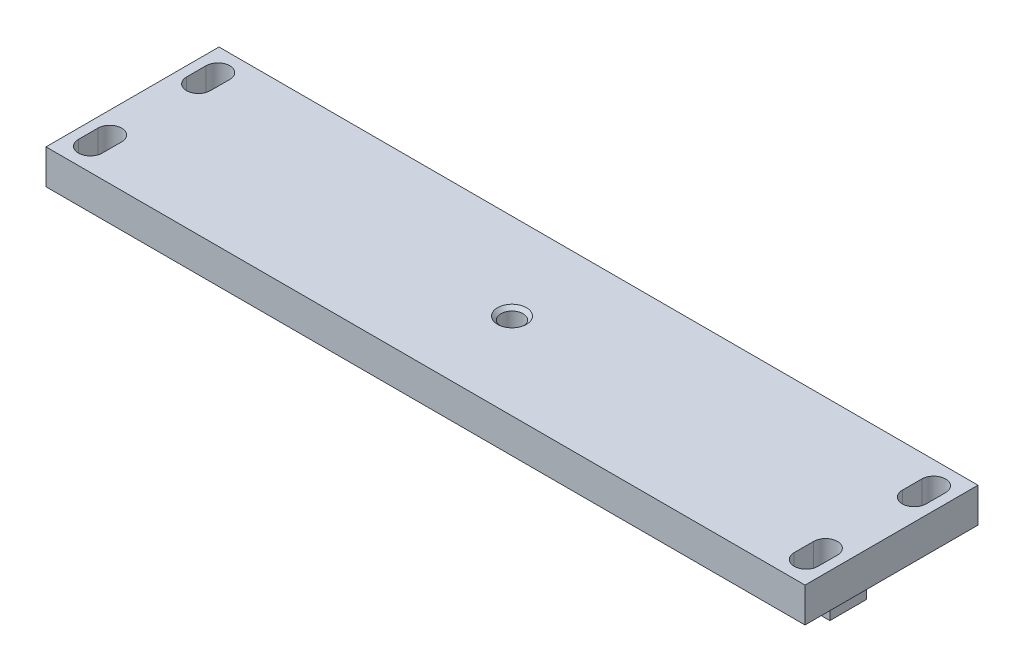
ISO-10303-21;
HEADER;
FILE_DESCRIPTION(('STEP AP214'),'2;1');
FILE_NAME('part.step','',(''),(''),'','','');
FILE_SCHEMA(('AUTOMOTIVE_DESIGN { 1 0 10303 214 1 1 1 1 }'));
ENDSEC;
DATA;
#1=APPLICATION_CONTEXT('core data for automotive mechanical design processes');
#2=APPLICATION_PROTOCOL_DEFINITION('international standard','automotive_design',2000,#1);
#3=PRODUCT_CONTEXT('',#1,'mechanical');
#4=PRODUCT('Part','Part','',(#3));
#5=PRODUCT_RELATED_PRODUCT_CATEGORY('part','',(#4));
#6=PRODUCT_DEFINITION_FORMATION('','',#4);
#7=PRODUCT_DEFINITION_CONTEXT('part definition',#1,'design');
#8=PRODUCT_DEFINITION('design','',#6,#7);
#9=PRODUCT_DEFINITION_SHAPE('','',#8);
#10=(LENGTH_UNIT() NAMED_UNIT(*) SI_UNIT(.MILLI.,.METRE.));
#11=(NAMED_UNIT(*) PLANE_ANGLE_UNIT() SI_UNIT($,.RADIAN.));
#12=(NAMED_UNIT(*) SI_UNIT($,.STERADIAN.) SOLID_ANGLE_UNIT());
#13=UNCERTAINTY_MEASURE_WITH_UNIT(LENGTH_MEASURE(1.E-05),#10,'distance_accuracy_value','');
#14=(GEOMETRIC_REPRESENTATION_CONTEXT(3) GLOBAL_UNCERTAINTY_ASSIGNED_CONTEXT((#13)) GLOBAL_UNIT_ASSIGNED_CONTEXT((#10,
#11,#12)) REPRESENTATION_CONTEXT('',''));
#15=CARTESIAN_POINT('',(0.,0.,0.));
#16=DIRECTION('',(0.,0.,1.));
#17=DIRECTION('',(1.,0.,0.));
#18=AXIS2_PLACEMENT_3D('',#15,#16,#17);
#19=CARTESIAN_POINT('',(351.000000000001,-31.0000000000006,-31.5000000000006));
#20=DIRECTION('',(0.,0.,-1.));
#21=DIRECTION('',(0.,0.999999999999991,0.));
#22=AXIS2_PLACEMENT_3D('',#19,#20,#21);
#23=PLANE('',#22);
#24=CARTESIAN_POINT('',(221.,-19.9999999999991,-31.5000000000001));
#25=DIRECTION('',(0.,0.,-1.));
#26=DIRECTION('',(0.,0.999999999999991,0.));
#27=AXIS2_PLACEMENT_3D('',#24,#25,#26);
#28=CIRCLE('',#27,6.00000000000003);
#29=CARTESIAN_POINT('',(221.,-13.9999999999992,-31.5000000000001));
#30=VERTEX_POINT('',#29);
#31=EDGE_CURVE('E11',#30,#30,#28,.T.);
#32=ORIENTED_EDGE('',*,*,#31,.T.);
#33=EDGE_LOOP('',(#32));
#34=FACE_BOUND('',#33,.T.);
#35=CARTESIAN_POINT('',(134.000000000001,-20.0000000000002,-31.5000000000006));
#36=DIRECTION('',(0.,0.,-1.));
#37=DIRECTION('',(0.,0.999999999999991,0.));
#38=AXIS2_PLACEMENT_3D('',#35,#36,#37);
#39=CIRCLE('',#38,6.00000000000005);
#40=CARTESIAN_POINT('',(134.,-13.9999999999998,-31.5));
#41=VERTEX_POINT('',#40);
#42=CARTESIAN_POINT('',(134.,-25.9999999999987,-31.5000000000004));
#43=VERTEX_POINT('',#42);
#44=EDGE_CURVE('E57',#41,#43,#39,.T.);
#45=ORIENTED_EDGE('',*,*,#44,.T.);
#46=DIRECTION('',(-1.,0.,0.));
#47=VECTOR('',#46,1.);
#48=CARTESIAN_POINT('',(351.000000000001,-26.0000000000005,-31.4999999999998));
#49=LINE('',#48,#47);
#50=CARTESIAN_POINT('',(128.,-25.9999999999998,-31.5000000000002));
#51=VERTEX_POINT('',#50);
#52=EDGE_CURVE('E49',#43,#51,#49,.T.);
#53=ORIENTED_EDGE('',*,*,#52,.T.);
#54=CARTESIAN_POINT('',(128.000000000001,-20.0000000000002,-31.5000000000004));
#55=DIRECTION('',(0.,0.,-1.));
#56=DIRECTION('',(0.,0.999999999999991,0.));
#57=AXIS2_PLACEMENT_3D('',#54,#55,#56);
#58=CIRCLE('',#57,6.00000000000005);
#59=CARTESIAN_POINT('',(128.,-14.0000000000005,-31.5000000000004));
#60=VERTEX_POINT('',#59);
#61=EDGE_CURVE('E595',#51,#60,#58,.T.);
#62=ORIENTED_EDGE('',*,*,#61,.T.);
#63=DIRECTION('',(1.,0.,0.));
#64=VECTOR('',#63,1.);
#65=CARTESIAN_POINT('',(351.000000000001,-14.0000000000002,-31.4999999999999));
#66=LINE('',#65,#64);
#67=EDGE_CURVE('E593',#60,#41,#66,.T.);
#68=ORIENTED_EDGE('',*,*,#67,.T.);
#69=EDGE_LOOP('',(#45,#53,#62,#68));
#70=FACE_BOUND('',#69,.T.);
#71=DIRECTION('',(-1.,0.,0.));
#72=VECTOR('',#71,1.);
#73=CARTESIAN_POINT('',(351.000000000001,-31.0000000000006,-31.5000000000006));
#74=LINE('',#73,#72);
#75=CARTESIAN_POINT('',(251.,-30.9999999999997,-31.4999999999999));
#76=VERTEX_POINT('',#75);
#77=CARTESIAN_POINT('',(101.000000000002,-31.0000000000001,-31.5000000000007));
#78=VERTEX_POINT('',#77);
#79=EDGE_CURVE('E521',#76,#78,#74,.T.);
#80=ORIENTED_EDGE('',*,*,#79,.F.);
#81=DIRECTION('',(0.,-0.999999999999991,0.));
#82=VECTOR('',#81,1.);
#83=CARTESIAN_POINT('',(251.000000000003,-24.0000000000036,-31.5000000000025));
#84=LINE('',#83,#82);
#85=CARTESIAN_POINT('',(251.000000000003,-24.0000000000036,-31.5000000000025));
#86=VERTEX_POINT('',#85);
#87=EDGE_CURVE('E454',#86,#76,#84,.T.);
#88=ORIENTED_EDGE('',*,*,#87,.F.);
#89=DIRECTION('',(-1.,0.,0.));
#90=VECTOR('',#89,1.);
#91=CARTESIAN_POINT('',(331.000000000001,-24.0000000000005,-31.4999999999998));
#92=LINE('',#91,#90);
#93=CARTESIAN_POINT('',(331.000000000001,-24.0000000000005,-31.4999999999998));
#94=VERTEX_POINT('',#93);
#95=EDGE_CURVE('E450',#94,#86,#92,.T.);
#96=ORIENTED_EDGE('',*,*,#95,.F.);
#97=DIRECTION('',(0.,-0.999999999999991,0.));
#98=VECTOR('',#97,1.);
#99=CARTESIAN_POINT('',(331.000000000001,2.22044604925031E-13,-31.500000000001));
#100=LINE('',#99,#98);
#101=CARTESIAN_POINT('',(331.000000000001,2.22044604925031E-13,-31.500000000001));
#102=VERTEX_POINT('',#101);
#103=EDGE_CURVE('E447',#102,#94,#100,.T.);
#104=ORIENTED_EDGE('',*,*,#103,.F.);
#105=DIRECTION('',(-1.,0.,0.));
#106=VECTOR('',#105,1.);
#107=CARTESIAN_POINT('',(351.,0.,-31.4999999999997));
#108=LINE('',#107,#106);
#109=CARTESIAN_POINT('',(20.0000000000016,-2.22044604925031E-13,-31.5));
#110=VERTEX_POINT('',#109);
#111=EDGE_CURVE('E524',#102,#110,#108,.T.);
#112=ORIENTED_EDGE('',*,*,#111,.T.);
#113=DIRECTION('',(0.,0.999999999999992,0.));
#114=VECTOR('',#113,1.);
#115=CARTESIAN_POINT('',(20.0000000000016,-2.22044604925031E-13,-31.5));
#116=LINE('',#115,#114);
#117=CARTESIAN_POINT('',(20.0000000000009,-23.9999999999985,-31.5000000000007));
#118=VERTEX_POINT('',#117);
#119=EDGE_CURVE('E471',#118,#110,#116,.T.);
#120=ORIENTED_EDGE('',*,*,#119,.F.);
#121=DIRECTION('',(-1.,0.,0.));
#122=VECTOR('',#121,1.);
#123=CARTESIAN_POINT('',(20.0000000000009,-23.9999999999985,-31.5000000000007));
#124=LINE('',#123,#122);
#125=CARTESIAN_POINT('',(101.000000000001,-23.9999999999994,-31.5000000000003));
#126=VERTEX_POINT('',#125);
#127=EDGE_CURVE('E468',#126,#118,#124,.T.);
#128=ORIENTED_EDGE('',*,*,#127,.F.);
#129=DIRECTION('',(0.,0.999999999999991,0.));
#130=VECTOR('',#129,1.);
#131=CARTESIAN_POINT('',(101.000000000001,-23.9999999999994,-31.5000000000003));
#132=LINE('',#131,#130);
#133=EDGE_CURVE('E446',#78,#126,#132,.T.);
#134=ORIENTED_EDGE('',*,*,#133,.F.);
#135=EDGE_LOOP('',(#80,#88,#96,#104,#112,#120,#128,#134));
#136=FACE_BOUND('',#135,.T.);
#137=ADVANCED_FACE('F40',(#34,#70,#136),#23,.F.);
#138=CARTESIAN_POINT('',(351.,-30.9999999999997,-48.4999999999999));
#139=DIRECTION('',(0.,0.999999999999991,0.));
#140=DIRECTION('',(0.,0.,1.));
#141=AXIS2_PLACEMENT_3D('',#138,#139,#140);
#142=PLANE('',#141);
#143=DIRECTION('',(-1.,0.,0.));
#144=VECTOR('',#143,1.);
#145=CARTESIAN_POINT('',(351.,-30.9999999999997,-48.4999999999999));
#146=LINE('',#145,#144);
#147=CARTESIAN_POINT('',(251.000000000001,-31.0000000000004,-48.5000000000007));
#148=VERTEX_POINT('',#147);
#149=CARTESIAN_POINT('',(101.,-30.9999999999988,-48.5000000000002));
#150=VERTEX_POINT('',#149);
#151=EDGE_CURVE('E518',#148,#150,#146,.T.);
#152=ORIENTED_EDGE('',*,*,#151,.F.);
#153=DIRECTION('',(0.,0.,1.));
#154=VECTOR('',#153,1.);
#155=CARTESIAN_POINT('',(251.000000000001,-30.9999999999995,-80.0000000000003));
#156=LINE('',#155,#154);
#157=EDGE_CURVE('E457',#148,#76,#156,.T.);
#158=ORIENTED_EDGE('',*,*,#157,.T.);
#159=ORIENTED_EDGE('',*,*,#79,.T.);
#160=DIRECTION('',(0.,0.,1.));
#161=VECTOR('',#160,1.);
#162=CARTESIAN_POINT('',(101.,-30.999999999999,-80.0000000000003));
#163=LINE('',#162,#161);
#164=EDGE_CURVE('E474',#150,#78,#163,.T.);
#165=ORIENTED_EDGE('',*,*,#164,.F.);
#166=EDGE_LOOP('',(#152,#158,#159,#165));
#167=FACE_BOUND('',#166,.T.);
#168=ADVANCED_FACE('F673',(#167),#142,.F.);
#169=CARTESIAN_POINT('',(351.,0.,-48.5000000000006));
#170=DIRECTION('',(0.,0.,1.));
#171=DIRECTION('',(1.,0.,0.));
#172=AXIS2_PLACEMENT_3D('',#169,#170,#171);
#173=PLANE('',#172);
#174=CARTESIAN_POINT('',(134.000000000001,-19.9999999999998,-48.5000000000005));
#175=DIRECTION('',(0.,0.,1.));
#176=DIRECTION('',(1.,0.,0.));
#177=AXIS2_PLACEMENT_3D('',#174,#175,#176);
#178=CIRCLE('',#177,5.99999999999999);
#179=CARTESIAN_POINT('',(134.,-25.9999999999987,-48.5000000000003));
#180=VERTEX_POINT('',#179);
#181=CARTESIAN_POINT('',(134.000000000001,-13.9999999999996,-48.5000000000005));
#182=VERTEX_POINT('',#181);
#183=EDGE_CURVE('E562',#180,#182,#178,.T.);
#184=ORIENTED_EDGE('',*,*,#183,.T.);
#185=DIRECTION('',(-1.,0.,0.));
#186=VECTOR('',#185,1.);
#187=CARTESIAN_POINT('',(351.,-13.9999999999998,-48.5000000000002));
#188=LINE('',#187,#186);
#189=CARTESIAN_POINT('',(128.000000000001,-13.9999999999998,-48.5000000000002));
#190=VERTEX_POINT('',#189);
#191=EDGE_CURVE('E566',#182,#190,#188,.T.);
#192=ORIENTED_EDGE('',*,*,#191,.T.);
#193=CARTESIAN_POINT('',(128.,-19.9999999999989,-48.5000000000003));
#194=DIRECTION('',(0.,0.,1.));
#195=DIRECTION('',(1.,0.,0.));
#196=AXIS2_PLACEMENT_3D('',#193,#194,#195);
#197=CIRCLE('',#196,5.99999999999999);
#198=CARTESIAN_POINT('',(128.000000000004,-26.0000000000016,-48.5000000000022));
#199=VERTEX_POINT('',#198);
#200=EDGE_CURVE('E564',#190,#199,#197,.T.);
#201=ORIENTED_EDGE('',*,*,#200,.T.);
#202=DIRECTION('',(1.,0.,0.));
#203=VECTOR('',#202,1.);
#204=CARTESIAN_POINT('',(351.000000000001,-26.,-48.5000000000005));
#205=LINE('',#204,#203);
#206=EDGE_CURVE('E560',#199,#180,#205,.T.);
#207=ORIENTED_EDGE('',*,*,#206,.T.);
#208=EDGE_LOOP('',(#184,#192,#201,#207));
#209=FACE_BOUND('',#208,.T.);
#210=CARTESIAN_POINT('',(221.,-19.9999999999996,-48.5000000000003));
#211=DIRECTION('',(0.,0.,1.));
#212=DIRECTION('',(1.,0.,0.));
#213=AXIS2_PLACEMENT_3D('',#210,#211,#212);
#214=CIRCLE('',#213,6.00000000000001);
#215=CARTESIAN_POINT('',(227.,-19.9999999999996,-48.5000000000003));
#216=VERTEX_POINT('',#215);
#217=EDGE_CURVE('E557',#216,#216,#214,.T.);
#218=ORIENTED_EDGE('',*,*,#217,.T.);
#219=EDGE_LOOP('',(#218));
#220=FACE_BOUND('',#219,.T.);
#221=DIRECTION('',(-1.,0.,0.));
#222=VECTOR('',#221,1.);
#223=CARTESIAN_POINT('',(351.,-23.9999999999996,-48.5));
#224=LINE('',#223,#222);
#225=CARTESIAN_POINT('',(331.000000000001,-24.0000000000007,-48.5000000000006));
#226=VERTEX_POINT('',#225);
#227=CARTESIAN_POINT('',(251.000000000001,-24.0000000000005,-48.5000000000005));
#228=VERTEX_POINT('',#227);
#229=EDGE_CURVE('E533',#226,#228,#224,.T.);
#230=ORIENTED_EDGE('',*,*,#229,.T.);
#231=DIRECTION('',(0.,-0.999999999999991,0.));
#232=VECTOR('',#231,1.);
#233=CARTESIAN_POINT('',(251.000000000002,-2.22044604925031E-13,-48.5000000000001));
#234=LINE('',#233,#232);
#235=EDGE_CURVE('E536',#228,#148,#234,.T.);
#236=ORIENTED_EDGE('',*,*,#235,.T.);
#237=ORIENTED_EDGE('',*,*,#151,.T.);
#238=DIRECTION('',(0.,0.999999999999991,0.));
#239=VECTOR('',#238,1.);
#240=CARTESIAN_POINT('',(101.,0.,-48.4999999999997));
#241=LINE('',#240,#239);
#242=CARTESIAN_POINT('',(101.,-23.9999999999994,-48.5000000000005));
#243=VERTEX_POINT('',#242);
#244=EDGE_CURVE('E527',#150,#243,#241,.T.);
#245=ORIENTED_EDGE('',*,*,#244,.T.);
#246=DIRECTION('',(-1.,0.,0.));
#247=VECTOR('',#246,1.);
#248=CARTESIAN_POINT('',(351.,-23.9999999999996,-48.5));
#249=LINE('',#248,#247);
#250=CARTESIAN_POINT('',(20.0000000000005,-23.9999999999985,-48.5000000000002));
#251=VERTEX_POINT('',#250);
#252=EDGE_CURVE('E530',#243,#251,#249,.T.);
#253=ORIENTED_EDGE('',*,*,#252,.T.);
#254=DIRECTION('',(0.,0.999999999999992,0.));
#255=VECTOR('',#254,1.);
#256=CARTESIAN_POINT('',(20.0000000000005,2.22044604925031E-13,-48.5000000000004));
#257=LINE('',#256,#255);
#258=CARTESIAN_POINT('',(20.0000000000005,2.22044604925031E-13,-48.5000000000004));
#259=VERTEX_POINT('',#258);
#260=EDGE_CURVE('E460',#251,#259,#257,.T.);
#261=ORIENTED_EDGE('',*,*,#260,.T.);
#262=DIRECTION('',(-1.,0.,0.));
#263=VECTOR('',#262,1.);
#264=CARTESIAN_POINT('',(351.,0.,-48.5000000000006));
#265=LINE('',#264,#263);
#266=CARTESIAN_POINT('',(331.000000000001,-2.22044604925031E-13,-48.5000000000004));
#267=VERTEX_POINT('',#266);
#268=EDGE_CURVE('E515',#267,#259,#265,.T.);
#269=ORIENTED_EDGE('',*,*,#268,.F.);
#270=DIRECTION('',(0.,-0.999999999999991,0.));
#271=VECTOR('',#270,1.);
#272=CARTESIAN_POINT('',(331.000000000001,-2.22044604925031E-13,-48.5000000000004));
#273=LINE('',#272,#271);
#274=EDGE_CURVE('E483',#267,#226,#273,.T.);
#275=ORIENTED_EDGE('',*,*,#274,.T.);
#276=EDGE_LOOP('',(#230,#236,#237,#245,#253,#261,#269,#275));
#277=FACE_BOUND('',#276,.T.);
#278=ADVANCED_FACE('F653',(#209,#220,#277),#173,.F.);
#279=CARTESIAN_POINT('',(351.,-2.22044604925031E-13,-80.0000000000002));
#280=DIRECTION('',(0.,0.999999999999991,0.));
#281=DIRECTION('',(0.,0.,1.));
#282=AXIS2_PLACEMENT_3D('',#279,#280,#281);
#283=PLANE('',#282);
#284=DIRECTION('',(0.,0.,-1.));
#285=VECTOR('',#284,1.);
#286=CARTESIAN_POINT('',(15.5000000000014,-2.22044604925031E-13,-80.0000000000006));
#287=LINE('',#286,#285);
#288=CARTESIAN_POINT('',(15.5000000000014,8.88178419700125E-13,-10.5000000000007));
#289=VERTEX_POINT('',#288);
#290=CARTESIAN_POINT('',(15.5000000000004,0.,-19.5000000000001));
#291=VERTEX_POINT('',#290);
#292=EDGE_CURVE('E440',#289,#291,#287,.T.);
#293=ORIENTED_EDGE('',*,*,#292,.T.);
#294=CARTESIAN_POINT('',(10.0000000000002,1.77635683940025E-12,-19.5000000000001));
#295=DIRECTION('',(0.,0.999999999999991,0.));
#296=DIRECTION('',(0.,0.,1.));
#297=AXIS2_PLACEMENT_3D('',#294,#295,#296);
#298=CIRCLE('',#297,5.5);
#299=CARTESIAN_POINT('',(4.50000000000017,8.88178419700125E-13,-19.5));
#300=VERTEX_POINT('',#299);
#301=EDGE_CURVE('E443',#291,#300,#298,.T.);
#302=ORIENTED_EDGE('',*,*,#301,.T.);
#303=DIRECTION('',(0.,0.,1.));
#304=VECTOR('',#303,1.);
#305=CARTESIAN_POINT('',(4.50000000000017,8.88178419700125E-13,-80.0000000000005));
#306=LINE('',#305,#304);
#307=CARTESIAN_POINT('',(4.50000000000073,8.88178419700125E-13,-10.5000000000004));
#308=VERTEX_POINT('',#307);
#309=EDGE_CURVE('E434',#300,#308,#306,.T.);
#310=ORIENTED_EDGE('',*,*,#309,.T.);
#311=CARTESIAN_POINT('',(10.0000000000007,1.11022302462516E-12,-10.5));
#312=DIRECTION('',(0.,0.999999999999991,0.));
#313=DIRECTION('',(0.,0.,1.));
#314=AXIS2_PLACEMENT_3D('',#311,#312,#313);
#315=CIRCLE('',#314,5.5);
#316=EDGE_CURVE('E437',#308,#289,#315,.T.);
#317=ORIENTED_EDGE('',*,*,#316,.T.);
#318=EDGE_LOOP('',(#293,#302,#310,#317));
#319=FACE_BOUND('',#318,.T.);
#320=DIRECTION('',(0.,0.,-1.));
#321=VECTOR('',#320,1.);
#322=CARTESIAN_POINT('',(346.500000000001,6.66133814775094E-13,-80.0000000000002));
#323=LINE('',#322,#321);
#324=CARTESIAN_POINT('',(346.500000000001,2.22044604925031E-13,-60.5000000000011));
#325=VERTEX_POINT('',#324);
#326=CARTESIAN_POINT('',(346.5,0.,-69.5000000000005));
#327=VERTEX_POINT('',#326);
#328=EDGE_CURVE('E428',#325,#327,#323,.T.);
#329=ORIENTED_EDGE('',*,*,#328,.T.);
#330=CARTESIAN_POINT('',(341.000000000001,-8.88178419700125E-13,-69.5000000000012));
#331=DIRECTION('',(0.,0.999999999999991,0.));
#332=DIRECTION('',(0.,0.,1.));
#333=AXIS2_PLACEMENT_3D('',#330,#331,#332);
#334=CIRCLE('',#333,5.50000000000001);
#335=CARTESIAN_POINT('',(335.500000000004,-2.88657986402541E-12,-69.5000000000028));
#336=VERTEX_POINT('',#335);
#337=EDGE_CURVE('E431',#327,#336,#334,.T.);
#338=ORIENTED_EDGE('',*,*,#337,.T.);
#339=DIRECTION('',(0.,0.,1.));
#340=VECTOR('',#339,1.);
#341=CARTESIAN_POINT('',(335.500000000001,4.44089209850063E-13,-79.9999999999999));
#342=LINE('',#341,#340);
#343=CARTESIAN_POINT('',(335.500000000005,-1.99840144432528E-12,-60.5000000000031));
#344=VERTEX_POINT('',#343);
#345=EDGE_CURVE('E422',#336,#344,#342,.T.);
#346=ORIENTED_EDGE('',*,*,#345,.T.);
#347=CARTESIAN_POINT('',(341.000000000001,4.44089209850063E-13,-60.5000000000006));
#348=DIRECTION('',(0.,0.999999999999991,0.));
#349=DIRECTION('',(0.,0.,1.));
#350=AXIS2_PLACEMENT_3D('',#347,#348,#349);
#351=CIRCLE('',#350,5.50000000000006);
#352=EDGE_CURVE('E425',#344,#325,#351,.T.);
#353=ORIENTED_EDGE('',*,*,#352,.T.);
#354=EDGE_LOOP('',(#329,#338,#346,#353));
#355=FACE_BOUND('',#354,.T.);
#356=DIRECTION('',(0.,0.,-1.));
#357=VECTOR('',#356,1.);
#358=CARTESIAN_POINT('',(346.500000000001,-6.66133814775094E-13,-80.));
#359=LINE('',#358,#357);
#360=CARTESIAN_POINT('',(346.500000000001,-1.11022302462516E-12,-10.5000000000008));
#361=VERTEX_POINT('',#360);
#362=CARTESIAN_POINT('',(346.500000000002,-1.55431223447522E-12,-19.5000000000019));
#363=VERTEX_POINT('',#362);
#364=EDGE_CURVE('E416',#361,#363,#359,.T.);
#365=ORIENTED_EDGE('',*,*,#364,.T.);
#366=CARTESIAN_POINT('',(341.000000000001,8.88178419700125E-13,-19.5000000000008));
#367=DIRECTION('',(0.,0.999999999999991,0.));
#368=DIRECTION('',(0.,0.,1.));
#369=AXIS2_PLACEMENT_3D('',#366,#367,#368);
#370=CIRCLE('',#369,5.50000000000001);
#371=CARTESIAN_POINT('',(335.500000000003,-1.11022302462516E-12,-19.5000000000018));
#372=VERTEX_POINT('',#371);
#373=EDGE_CURVE('E419',#363,#372,#370,.T.);
#374=ORIENTED_EDGE('',*,*,#373,.T.);
#375=DIRECTION('',(0.,0.,1.));
#376=VECTOR('',#375,1.);
#377=CARTESIAN_POINT('',(335.500000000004,-3.33066907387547E-12,-80.0000000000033));
#378=LINE('',#377,#376);
#379=CARTESIAN_POINT('',(335.5,4.44089209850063E-13,-10.5000000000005));
#380=VERTEX_POINT('',#379);
#381=EDGE_CURVE('E410',#372,#380,#378,.T.);
#382=ORIENTED_EDGE('',*,*,#381,.T.);
#383=CARTESIAN_POINT('',(341.000000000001,0.,-10.5000000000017));
#384=DIRECTION('',(0.,0.999999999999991,0.));
#385=DIRECTION('',(0.,0.,1.));
#386=AXIS2_PLACEMENT_3D('',#383,#384,#385);
#387=CIRCLE('',#386,5.49999999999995);
#388=EDGE_CURVE('E413',#380,#361,#387,.T.);
#389=ORIENTED_EDGE('',*,*,#388,.T.);
#390=EDGE_LOOP('',(#365,#374,#382,#389));
#391=FACE_BOUND('',#390,.T.);
#392=DIRECTION('',(0.,0.,-1.));
#393=VECTOR('',#392,1.);
#394=CARTESIAN_POINT('',(15.5000000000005,1.55431223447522E-12,-80.0000000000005));
#395=LINE('',#394,#393);
#396=CARTESIAN_POINT('',(15.5000000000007,0.,-60.5));
#397=VERTEX_POINT('',#396);
#398=CARTESIAN_POINT('',(15.5000000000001,1.11022302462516E-12,-69.5000000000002));
#399=VERTEX_POINT('',#398);
#400=EDGE_CURVE('E404',#397,#399,#395,.T.);
#401=ORIENTED_EDGE('',*,*,#400,.T.);
#402=CARTESIAN_POINT('',(10.0000000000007,1.77635683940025E-12,-69.5000000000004));
#403=DIRECTION('',(0.,0.999999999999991,0.));
#404=DIRECTION('',(0.,0.,1.));
#405=AXIS2_PLACEMENT_3D('',#402,#403,#404);
#406=CIRCLE('',#405,5.5);
#407=CARTESIAN_POINT('',(4.50000000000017,2.22044604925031E-12,-69.5000000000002));
#408=VERTEX_POINT('',#407);
#409=EDGE_CURVE('E407',#399,#408,#406,.T.);
#410=ORIENTED_EDGE('',*,*,#409,.T.);
#411=DIRECTION('',(0.,0.,1.));
#412=VECTOR('',#411,1.);
#413=CARTESIAN_POINT('',(4.50000000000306,-2.22044604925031E-12,-80.0000000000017));
#414=LINE('',#413,#412);
#415=CARTESIAN_POINT('',(4.50000000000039,2.22044604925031E-13,-60.4999999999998));
#416=VERTEX_POINT('',#415);
#417=EDGE_CURVE('E392',#408,#416,#414,.T.);
#418=ORIENTED_EDGE('',*,*,#417,.T.);
#419=CARTESIAN_POINT('',(10.0000000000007,1.33226762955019E-12,-60.5000000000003));
#420=DIRECTION('',(0.,0.999999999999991,0.));
#421=DIRECTION('',(0.,0.,1.));
#422=AXIS2_PLACEMENT_3D('',#419,#420,#421);
#423=CIRCLE('',#422,5.5);
#424=EDGE_CURVE('E401',#416,#397,#423,.T.);
#425=ORIENTED_EDGE('',*,*,#424,.T.);
#426=EDGE_LOOP('',(#401,#410,#418,#425));
#427=FACE_BOUND('',#426,.T.);
#428=ORIENTED_EDGE('',*,*,#111,.F.);
#429=DIRECTION('',(0.,0.,1.));
#430=VECTOR('',#429,1.);
#431=CARTESIAN_POINT('',(331.000000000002,-4.44089209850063E-13,-80.0000000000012));
#432=LINE('',#431,#430);
#433=EDGE_CURVE('E456',#267,#102,#432,.T.);
#434=ORIENTED_EDGE('',*,*,#433,.F.);
#435=ORIENTED_EDGE('',*,*,#268,.T.);
#436=DIRECTION('',(0.,0.,1.));
#437=VECTOR('',#436,1.);
#438=CARTESIAN_POINT('',(20.0000000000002,2.22044604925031E-13,-80.0000000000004));
#439=LINE('',#438,#437);
#440=EDGE_CURVE('E451',#259,#110,#439,.T.);
#441=ORIENTED_EDGE('',*,*,#440,.T.);
#442=EDGE_LOOP('',(#428,#434,#435,#441));
#443=FACE_BOUND('',#442,.T.);
#444=DIRECTION('',(0.,0.,-1.));
#445=VECTOR('',#444,1.);
#446=CARTESIAN_POINT('',(1.11022302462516E-13,1.55431223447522E-12,-80.0000000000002));
#447=LINE('',#446,#445);
#448=CARTESIAN_POINT('',(0.,0.,0.));
#449=VERTEX_POINT('',#448);
#450=CARTESIAN_POINT('',(1.11022302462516E-13,1.55431223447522E-12,-80.0000000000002));
#451=VERTEX_POINT('',#450);
#452=EDGE_CURVE('E486',#449,#451,#447,.T.);
#453=ORIENTED_EDGE('',*,*,#452,.T.);
#454=DIRECTION('',(-1.,0.,0.));
#455=VECTOR('',#454,1.);
#456=CARTESIAN_POINT('',(351.,-2.22044604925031E-13,-80.0000000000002));
#457=LINE('',#456,#455);
#458=CARTESIAN_POINT('',(351.,-2.22044604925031E-13,-80.0000000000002));
#459=VERTEX_POINT('',#458);
#460=EDGE_CURVE('E513',#459,#451,#457,.T.);
#461=ORIENTED_EDGE('',*,*,#460,.F.);
#462=DIRECTION('',(0.,0.,-1.));
#463=VECTOR('',#462,1.);
#464=CARTESIAN_POINT('',(351.,0.,-31.4999999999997));
#465=LINE('',#464,#463);
#466=CARTESIAN_POINT('',(351.,-2.22044604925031E-13,-3.46944695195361E-13));
#467=VERTEX_POINT('',#466);
#468=EDGE_CURVE('E487',#467,#459,#465,.T.);
#469=ORIENTED_EDGE('',*,*,#468,.F.);
#470=DIRECTION('',(-1.,0.,0.));
#471=VECTOR('',#470,1.);
#472=CARTESIAN_POINT('',(351.,-2.22044604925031E-13,-3.46944695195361E-13));
#473=LINE('',#472,#471);
#474=EDGE_CURVE('E496',#467,#449,#473,.T.);
#475=ORIENTED_EDGE('',*,*,#474,.T.);
#476=EDGE_LOOP('',(#453,#461,#469,#475));
#477=FACE_BOUND('',#476,.T.);
#478=ADVANCED_FACE('F1091',(#319,#355,#391,#427,#443,#477),#283,.F.);
#479=CARTESIAN_POINT('',(351.000000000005,15.999999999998,-80.0000000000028));
#480=DIRECTION('',(0.,0.,1.));
#481=DIRECTION('',(1.,0.,0.));
#482=AXIS2_PLACEMENT_3D('',#479,#480,#481);
#483=PLANE('',#482);
#484=DIRECTION('',(0.,0.999999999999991,0.));
#485=VECTOR('',#484,1.);
#486=CARTESIAN_POINT('',(0.,16.0000000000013,-80.0000000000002));
#487=LINE('',#486,#485);
#488=CARTESIAN_POINT('',(0.,16.0000000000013,-80.0000000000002));
#489=VERTEX_POINT('',#488);
#490=EDGE_CURVE('E499',#451,#489,#487,.T.);
#491=ORIENTED_EDGE('',*,*,#490,.T.);
#492=DIRECTION('',(-1.,0.,0.));
#493=VECTOR('',#492,1.);
#494=CARTESIAN_POINT('',(351.000000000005,15.999999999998,-80.0000000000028));
#495=LINE('',#494,#493);
#496=CARTESIAN_POINT('',(351.000000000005,15.999999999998,-80.0000000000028));
#497=VERTEX_POINT('',#496);
#498=EDGE_CURVE('E510',#497,#489,#495,.T.);
#499=ORIENTED_EDGE('',*,*,#498,.F.);
#500=DIRECTION('',(0.,0.999999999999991,0.));
#501=VECTOR('',#500,1.);
#502=CARTESIAN_POINT('',(351.000000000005,15.999999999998,-80.0000000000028));
#503=LINE('',#502,#501);
#504=EDGE_CURVE('E489',#459,#497,#503,.T.);
#505=ORIENTED_EDGE('',*,*,#504,.F.);
#506=ORIENTED_EDGE('',*,*,#460,.T.);
#507=EDGE_LOOP('',(#491,#499,#505,#506));
#508=FACE_BOUND('',#507,.T.);
#509=ADVANCED_FACE('F1081',(#508),#483,.F.);
#510=CARTESIAN_POINT('',(351.000000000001,15.9999999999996,0.));
#511=DIRECTION('',(0.,-0.999999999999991,0.));
#512=DIRECTION('',(0.,0.,-1.));
#513=AXIS2_PLACEMENT_3D('',#510,#511,#512);
#514=PLANE('',#513);
#515=CARTESIAN_POINT('',(175.5,15.9999999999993,-39.9999999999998));
#516=DIRECTION('',(0.,-0.999999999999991,0.));
#517=DIRECTION('',(0.,0.,-1.));
#518=AXIS2_PLACEMENT_3D('',#515,#516,#517);
#519=CIRCLE('',#518,6.70000000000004);
#520=CARTESIAN_POINT('',(175.500000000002,15.9999999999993,-33.300000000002));
#521=VERTEX_POINT('',#520);
#522=EDGE_CURVE('E542',#521,#521,#519,.T.);
#523=ORIENTED_EDGE('',*,*,#522,.T.);
#524=EDGE_LOOP('',(#523));
#525=FACE_BOUND('',#524,.T.);
#526=DIRECTION('',(0.,0.,1.));
#527=VECTOR('',#526,1.);
#528=CARTESIAN_POINT('',(4.50000000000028,16.0000000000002,-19.5000000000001));
#529=LINE('',#528,#527);
#530=CARTESIAN_POINT('',(4.50000000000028,16.0000000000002,-19.5000000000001));
#531=VERTEX_POINT('',#530);
#532=CARTESIAN_POINT('',(4.50000000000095,16.0000000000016,-10.5000000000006));
#533=VERTEX_POINT('',#532);
#534=EDGE_CURVE('E341',#531,#533,#529,.T.);
#535=ORIENTED_EDGE('',*,*,#534,.F.);
#536=CARTESIAN_POINT('',(10.0000000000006,16.0000000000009,-19.5));
#537=DIRECTION('',(0.,0.999999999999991,0.));
#538=DIRECTION('',(0.,0.,1.));
#539=AXIS2_PLACEMENT_3D('',#536,#537,#538);
#540=CIRCLE('',#539,5.5);
#541=CARTESIAN_POINT('',(15.5000000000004,16.0000000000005,-19.5000000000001));
#542=VERTEX_POINT('',#541);
#543=EDGE_CURVE('E339',#542,#531,#540,.T.);
#544=ORIENTED_EDGE('',*,*,#543,.F.);
#545=DIRECTION('',(0.,0.,-1.));
#546=VECTOR('',#545,1.);
#547=CARTESIAN_POINT('',(15.5000000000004,16.0000000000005,-19.5000000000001));
#548=LINE('',#547,#546);
#549=CARTESIAN_POINT('',(15.5000000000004,16.0000000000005,-10.5000000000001));
#550=VERTEX_POINT('',#549);
#551=EDGE_CURVE('E348',#550,#542,#548,.T.);
#552=ORIENTED_EDGE('',*,*,#551,.F.);
#553=CARTESIAN_POINT('',(10.0000000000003,16.0000000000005,-10.5));
#554=DIRECTION('',(0.,0.999999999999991,0.));
#555=DIRECTION('',(0.,0.,1.));
#556=AXIS2_PLACEMENT_3D('',#553,#554,#555);
#557=CIRCLE('',#556,5.5);
#558=EDGE_CURVE('E345',#533,#550,#557,.T.);
#559=ORIENTED_EDGE('',*,*,#558,.F.);
#560=EDGE_LOOP('',(#535,#544,#552,#559));
#561=FACE_BOUND('',#560,.T.);
#562=DIRECTION('',(0.,0.,1.));
#563=VECTOR('',#562,1.);
#564=CARTESIAN_POINT('',(335.5,16.0000000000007,-69.5000000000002));
#565=LINE('',#564,#563);
#566=CARTESIAN_POINT('',(335.5,16.0000000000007,-69.5000000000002));
#567=VERTEX_POINT('',#566);
#568=CARTESIAN_POINT('',(335.5,16.0000000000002,-60.5000000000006));
#569=VERTEX_POINT('',#568);
#570=EDGE_CURVE('E362',#567,#569,#565,.T.);
#571=ORIENTED_EDGE('',*,*,#570,.F.);
#572=CARTESIAN_POINT('',(341.,15.9999999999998,-69.5000000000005));
#573=DIRECTION('',(0.,0.999999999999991,0.));
#574=DIRECTION('',(0.,0.,1.));
#575=AXIS2_PLACEMENT_3D('',#572,#573,#574);
#576=CIRCLE('',#575,5.50000000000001);
#577=CARTESIAN_POINT('',(346.5,16.0000000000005,-69.5000000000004));
#578=VERTEX_POINT('',#577);
#579=EDGE_CURVE('E332',#578,#567,#576,.T.);
#580=ORIENTED_EDGE('',*,*,#579,.F.);
#581=DIRECTION('',(0.,0.,-1.));
#582=VECTOR('',#581,1.);
#583=CARTESIAN_POINT('',(346.5,16.0000000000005,-69.5000000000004));
#584=LINE('',#583,#582);
#585=CARTESIAN_POINT('',(346.500000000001,16.0000000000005,-60.5000000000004));
#586=VERTEX_POINT('',#585);
#587=EDGE_CURVE('E368',#586,#578,#584,.T.);
#588=ORIENTED_EDGE('',*,*,#587,.F.);
#589=CARTESIAN_POINT('',(341.000000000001,15.9999999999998,-60.5000000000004));
#590=DIRECTION('',(0.,0.999999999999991,0.));
#591=DIRECTION('',(0.,0.,1.));
#592=AXIS2_PLACEMENT_3D('',#589,#590,#591);
#593=CIRCLE('',#592,5.50000000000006);
#594=EDGE_CURVE('E365',#569,#586,#593,.T.);
#595=ORIENTED_EDGE('',*,*,#594,.F.);
#596=EDGE_LOOP('',(#571,#580,#588,#595));
#597=FACE_BOUND('',#596,.T.);
#598=DIRECTION('',(0.,0.,1.));
#599=VECTOR('',#598,1.);
#600=CARTESIAN_POINT('',(335.5,15.9999999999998,-19.5000000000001));
#601=LINE('',#600,#599);
#602=CARTESIAN_POINT('',(335.5,15.9999999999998,-19.5000000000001));
#603=VERTEX_POINT('',#602);
#604=CARTESIAN_POINT('',(335.500000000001,15.9999999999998,-10.4999999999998));
#605=VERTEX_POINT('',#604);
#606=EDGE_CURVE('E320',#603,#605,#601,.T.);
#607=ORIENTED_EDGE('',*,*,#606,.F.);
#608=CARTESIAN_POINT('',(341.,16.,-19.5000000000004));
#609=DIRECTION('',(0.,0.999999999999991,0.));
#610=DIRECTION('',(0.,0.,1.));
#611=AXIS2_PLACEMENT_3D('',#608,#609,#610);
#612=CIRCLE('',#611,5.50000000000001);
#613=CARTESIAN_POINT('',(346.500000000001,16.,-19.5000000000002));
#614=VERTEX_POINT('',#613);
#615=EDGE_CURVE('E310',#614,#603,#612,.T.);
#616=ORIENTED_EDGE('',*,*,#615,.F.);
#617=DIRECTION('',(0.,0.,-1.));
#618=VECTOR('',#617,1.);
#619=CARTESIAN_POINT('',(346.500000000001,16.,-19.5000000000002));
#620=LINE('',#619,#618);
#621=CARTESIAN_POINT('',(346.500000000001,15.9999999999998,-10.5000000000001));
#622=VERTEX_POINT('',#621);
#623=EDGE_CURVE('E326',#622,#614,#620,.T.);
#624=ORIENTED_EDGE('',*,*,#623,.F.);
#625=CARTESIAN_POINT('',(341.,15.9999999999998,-10.5000000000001));
#626=DIRECTION('',(0.,0.999999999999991,0.));
#627=DIRECTION('',(0.,0.,1.));
#628=AXIS2_PLACEMENT_3D('',#625,#626,#627);
#629=CIRCLE('',#628,5.49999999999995);
#630=EDGE_CURVE('E323',#605,#622,#629,.T.);
#631=ORIENTED_EDGE('',*,*,#630,.F.);
#632=EDGE_LOOP('',(#607,#616,#624,#631));
#633=FACE_BOUND('',#632,.T.);
#634=DIRECTION('',(0.,0.,1.));
#635=VECTOR('',#634,1.);
#636=CARTESIAN_POINT('',(4.50000000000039,16.0000000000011,-69.5000000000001));
#637=LINE('',#636,#635);
#638=CARTESIAN_POINT('',(4.50000000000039,16.0000000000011,-69.5000000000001));
#639=VERTEX_POINT('',#638);
#640=CARTESIAN_POINT('',(4.49999999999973,16.0000000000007,-60.5000000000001));
#641=VERTEX_POINT('',#640);
#642=EDGE_CURVE('E380',#639,#641,#637,.T.);
#643=ORIENTED_EDGE('',*,*,#642,.F.);
#644=CARTESIAN_POINT('',(10.0000000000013,16.0000000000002,-69.5));
#645=DIRECTION('',(0.,0.999999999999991,0.));
#646=DIRECTION('',(0.,0.,1.));
#647=AXIS2_PLACEMENT_3D('',#644,#645,#646);
#648=CIRCLE('',#647,5.5);
#649=CARTESIAN_POINT('',(15.5000000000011,16.0000000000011,-69.5000000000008));
#650=VERTEX_POINT('',#649);
#651=EDGE_CURVE('E354',#650,#639,#648,.T.);
#652=ORIENTED_EDGE('',*,*,#651,.F.);
#653=DIRECTION('',(0.,0.,-1.));
#654=VECTOR('',#653,1.);
#655=CARTESIAN_POINT('',(15.5000000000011,16.0000000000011,-69.5000000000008));
#656=LINE('',#655,#654);
#657=CARTESIAN_POINT('',(15.5000000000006,16.0000000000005,-60.5000000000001));
#658=VERTEX_POINT('',#657);
#659=EDGE_CURVE('E386',#658,#650,#656,.T.);
#660=ORIENTED_EDGE('',*,*,#659,.F.);
#661=CARTESIAN_POINT('',(10.0000000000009,16.0000000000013,-60.5000000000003));
#662=DIRECTION('',(0.,0.999999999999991,0.));
#663=DIRECTION('',(0.,0.,1.));
#664=AXIS2_PLACEMENT_3D('',#661,#662,#663);
#665=CIRCLE('',#664,5.5);
#666=EDGE_CURVE('E383',#641,#658,#665,.T.);
#667=ORIENTED_EDGE('',*,*,#666,.F.);
#668=EDGE_LOOP('',(#643,#652,#660,#667));
#669=FACE_BOUND('',#668,.T.);
#670=DIRECTION('',(0.,0.,1.));
#671=VECTOR('',#670,1.);
#672=CARTESIAN_POINT('',(6.66133814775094E-13,16.0000000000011,0.));
#673=LINE('',#672,#671);
#674=CARTESIAN_POINT('',(6.66133814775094E-13,16.0000000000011,0.));
#675=VERTEX_POINT('',#674);
#676=EDGE_CURVE('E501',#489,#675,#673,.T.);
#677=ORIENTED_EDGE('',*,*,#676,.T.);
#678=DIRECTION('',(-1.,0.,0.));
#679=VECTOR('',#678,1.);
#680=CARTESIAN_POINT('',(351.000000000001,15.9999999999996,0.));
#681=LINE('',#680,#679);
#682=CARTESIAN_POINT('',(351.000000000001,15.9999999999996,0.));
#683=VERTEX_POINT('',#682);
#684=EDGE_CURVE('E507',#683,#675,#681,.T.);
#685=ORIENTED_EDGE('',*,*,#684,.F.);
#686=DIRECTION('',(0.,0.,1.));
#687=VECTOR('',#686,1.);
#688=CARTESIAN_POINT('',(351.000000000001,15.9999999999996,0.));
#689=LINE('',#688,#687);
#690=EDGE_CURVE('E492',#497,#683,#689,.T.);
#691=ORIENTED_EDGE('',*,*,#690,.F.);
#692=ORIENTED_EDGE('',*,*,#498,.T.);
#693=EDGE_LOOP('',(#677,#685,#691,#692));
#694=FACE_BOUND('',#693,.T.);
#695=ADVANCED_FACE('F1071',(#525,#561,#597,#633,#669,#694),#514,.F.);
#696=CARTESIAN_POINT('',(351.,-2.22044604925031E-13,-3.46944695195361E-13));
#697=DIRECTION('',(0.,0.,-1.));
#698=DIRECTION('',(-1.,0.,0.));
#699=AXIS2_PLACEMENT_3D('',#696,#697,#698);
#700=PLANE('',#699);
#701=DIRECTION('',(0.,-0.999999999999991,0.));
#702=VECTOR('',#701,1.);
#703=CARTESIAN_POINT('',(0.,0.,0.));
#704=LINE('',#703,#702);
#705=EDGE_CURVE('E490',#675,#449,#704,.T.);
#706=ORIENTED_EDGE('',*,*,#705,.T.);
#707=ORIENTED_EDGE('',*,*,#474,.F.);
#708=DIRECTION('',(0.,-0.999999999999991,0.));
#709=VECTOR('',#708,1.);
#710=CARTESIAN_POINT('',(351.,-2.22044604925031E-13,-3.46944695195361E-13));
#711=LINE('',#710,#709);
#712=EDGE_CURVE('E494',#683,#467,#711,.T.);
#713=ORIENTED_EDGE('',*,*,#712,.F.);
#714=ORIENTED_EDGE('',*,*,#684,.T.);
#715=EDGE_LOOP('',(#706,#707,#713,#714));
#716=FACE_BOUND('',#715,.T.);
#717=ADVANCED_FACE('F1061',(#716),#700,.F.);
#718=CARTESIAN_POINT('',(351.,-2.22044604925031E-13,-3.46944695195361E-13));
#719=DIRECTION('',(-1.,0.,0.));
#720=DIRECTION('',(0.,0.,1.));
#721=AXIS2_PLACEMENT_3D('',#718,#719,#720);
#722=PLANE('',#721);
#723=ORIENTED_EDGE('',*,*,#468,.T.);
#724=ORIENTED_EDGE('',*,*,#504,.T.);
#725=ORIENTED_EDGE('',*,*,#690,.T.);
#726=ORIENTED_EDGE('',*,*,#712,.T.);
#727=EDGE_LOOP('',(#723,#724,#725,#726));
#728=FACE_BOUND('',#727,.T.);
#729=ADVANCED_FACE('F1050',(#728),#722,.F.);
#730=CARTESIAN_POINT('',(0.,0.,0.));
#731=DIRECTION('',(-1.,0.,0.));
#732=DIRECTION('',(0.,0.,1.));
#733=AXIS2_PLACEMENT_3D('',#730,#731,#732);
#734=PLANE('',#733);
#735=ORIENTED_EDGE('',*,*,#452,.F.);
#736=ORIENTED_EDGE('',*,*,#705,.F.);
#737=ORIENTED_EDGE('',*,*,#676,.F.);
#738=ORIENTED_EDGE('',*,*,#490,.F.);
#739=EDGE_LOOP('',(#735,#736,#737,#738));
#740=FACE_BOUND('',#739,.T.);
#741=ADVANCED_FACE('F1039',(#740),#734,.T.);
#742=CARTESIAN_POINT('',(20.,-23.9999999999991,-80.0000000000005));
#743=DIRECTION('',(0.,0.999999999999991,0.));
#744=DIRECTION('',(0.,0.,1.));
#745=AXIS2_PLACEMENT_3D('',#742,#743,#744);
#746=PLANE('',#745);
#747=DIRECTION('',(0.,0.,1.));
#748=VECTOR('',#747,1.);
#749=CARTESIAN_POINT('',(101.000000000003,-24.0000000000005,-80.0000000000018));
#750=LINE('',#749,#748);
#751=EDGE_CURVE('E478',#243,#126,#750,.T.);
#752=ORIENTED_EDGE('',*,*,#751,.T.);
#753=ORIENTED_EDGE('',*,*,#127,.T.);
#754=DIRECTION('',(0.,0.,1.));
#755=VECTOR('',#754,1.);
#756=CARTESIAN_POINT('',(20.,-23.9999999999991,-80.0000000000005));
#757=LINE('',#756,#755);
#758=EDGE_CURVE('E476',#251,#118,#757,.T.);
#759=ORIENTED_EDGE('',*,*,#758,.F.);
#760=ORIENTED_EDGE('',*,*,#252,.F.);
#761=EDGE_LOOP('',(#752,#753,#759,#760));
#762=FACE_BOUND('',#761,.T.);
#763=ADVANCED_FACE('F1029',(#762),#746,.F.);
#764=CARTESIAN_POINT('',(101.000000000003,-24.0000000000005,-80.0000000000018));
#765=DIRECTION('',(1.,0.,0.));
#766=DIRECTION('',(0.,0.,-1.));
#767=AXIS2_PLACEMENT_3D('',#764,#765,#766);
#768=PLANE('',#767);
#769=ORIENTED_EDGE('',*,*,#164,.T.);
#770=ORIENTED_EDGE('',*,*,#133,.T.);
#771=ORIENTED_EDGE('',*,*,#751,.F.);
#772=ORIENTED_EDGE('',*,*,#244,.F.);
#773=EDGE_LOOP('',(#769,#770,#771,#772));
#774=FACE_BOUND('',#773,.T.);
#775=ADVANCED_FACE('F1019',(#774),#768,.F.);
#776=CARTESIAN_POINT('',(20.0000000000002,2.22044604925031E-13,-80.0000000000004));
#777=DIRECTION('',(1.,0.,0.));
#778=DIRECTION('',(0.,0.999999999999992,0.));
#779=AXIS2_PLACEMENT_3D('',#776,#777,#778);
#780=PLANE('',#779);
#781=CARTESIAN_POINT('',(20.0000000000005,-13.9999999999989,-40.0000000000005));
#782=DIRECTION('',(1.,0.,0.));
#783=DIRECTION('',(0.,0.999999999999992,0.));
#784=AXIS2_PLACEMENT_3D('',#781,#782,#783);
#785=CIRCLE('',#784,5.74999999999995);
#786=CARTESIAN_POINT('',(20.0000000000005,-8.249999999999,-40.0000000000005));
#787=VERTEX_POINT('',#786);
#788=EDGE_CURVE('E554',#787,#787,#785,.T.);
#789=ORIENTED_EDGE('',*,*,#788,.T.);
#790=EDGE_LOOP('',(#789));
#791=FACE_BOUND('',#790,.T.);
#792=ORIENTED_EDGE('',*,*,#758,.T.);
#793=ORIENTED_EDGE('',*,*,#119,.T.);
#794=ORIENTED_EDGE('',*,*,#440,.F.);
#795=ORIENTED_EDGE('',*,*,#260,.F.);
#796=EDGE_LOOP('',(#792,#793,#794,#795));
#797=FACE_BOUND('',#796,.T.);
#798=ADVANCED_FACE('F1009',(#791,#797),#780,.F.);
#799=CARTESIAN_POINT('',(250.999999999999,-23.9999999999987,-80.0000000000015));
#800=DIRECTION('',(-1.,0.,0.));
#801=DIRECTION('',(0.,0.,1.));
#802=AXIS2_PLACEMENT_3D('',#799,#800,#801);
#803=PLANE('',#802);
#804=DIRECTION('',(0.,0.,1.));
#805=VECTOR('',#804,1.);
#806=CARTESIAN_POINT('',(250.999999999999,-23.9999999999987,-80.0000000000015));
#807=LINE('',#806,#805);
#808=EDGE_CURVE('E461',#228,#86,#807,.T.);
#809=ORIENTED_EDGE('',*,*,#808,.T.);
#810=ORIENTED_EDGE('',*,*,#87,.T.);
#811=ORIENTED_EDGE('',*,*,#157,.F.);
#812=ORIENTED_EDGE('',*,*,#235,.F.);
#813=EDGE_LOOP('',(#809,#810,#811,#812));
#814=FACE_BOUND('',#813,.T.);
#815=ADVANCED_FACE('F999',(#814),#803,.F.);
#816=CARTESIAN_POINT('',(331.,-23.9999999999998,-79.9999999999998));
#817=DIRECTION('',(0.,0.999999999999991,0.));
#818=DIRECTION('',(-1.,0.,0.));
#819=AXIS2_PLACEMENT_3D('',#816,#817,#818);
#820=PLANE('',#819);
#821=DIRECTION('',(0.,0.,1.));
#822=VECTOR('',#821,1.);
#823=CARTESIAN_POINT('',(331.,-23.9999999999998,-79.9999999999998));
#824=LINE('',#823,#822);
#825=EDGE_CURVE('E463',#226,#94,#824,.T.);
#826=ORIENTED_EDGE('',*,*,#825,.T.);
#827=ORIENTED_EDGE('',*,*,#95,.T.);
#828=ORIENTED_EDGE('',*,*,#808,.F.);
#829=ORIENTED_EDGE('',*,*,#229,.F.);
#830=EDGE_LOOP('',(#826,#827,#828,#829));
#831=FACE_BOUND('',#830,.T.);
#832=ADVANCED_FACE('F989',(#831),#820,.F.);
#833=CARTESIAN_POINT('',(331.000000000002,-4.44089209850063E-13,-80.0000000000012));
#834=DIRECTION('',(-1.,0.,0.));
#835=DIRECTION('',(0.,0.,1.));
#836=AXIS2_PLACEMENT_3D('',#833,#834,#835);
#837=PLANE('',#836);
#838=CARTESIAN_POINT('',(331.000000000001,-13.9999999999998,-40.0000000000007));
#839=DIRECTION('',(-1.,0.,0.));
#840=DIRECTION('',(0.,0.,1.));
#841=AXIS2_PLACEMENT_3D('',#838,#839,#840);
#842=CIRCLE('',#841,5.75000000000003);
#843=CARTESIAN_POINT('',(331.000000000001,-13.9999999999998,-34.2500000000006));
#844=VERTEX_POINT('',#843);
#845=EDGE_CURVE('E548',#844,#844,#842,.T.);
#846=ORIENTED_EDGE('',*,*,#845,.T.);
#847=EDGE_LOOP('',(#846));
#848=FACE_BOUND('',#847,.T.);
#849=ORIENTED_EDGE('',*,*,#433,.T.);
#850=ORIENTED_EDGE('',*,*,#103,.T.);
#851=ORIENTED_EDGE('',*,*,#825,.F.);
#852=ORIENTED_EDGE('',*,*,#274,.F.);
#853=EDGE_LOOP('',(#849,#850,#851,#852));
#854=FACE_BOUND('',#853,.T.);
#855=ADVANCED_FACE('F979',(#848,#854),#837,.F.);
#856=CARTESIAN_POINT('',(10.0000000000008,-30.9999999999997,-69.5000000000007));
#857=DIRECTION('',(0.,0.999999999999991,0.));
#858=DIRECTION('',(0.,0.,1.));
#859=AXIS2_PLACEMENT_3D('',#856,#857,#858);
#860=CYLINDRICAL_SURFACE('',#859,5.5);
#861=DIRECTION('',(0.,0.999999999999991,0.));
#862=VECTOR('',#861,1.);
#863=CARTESIAN_POINT('',(15.5000000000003,-30.999999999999,-69.5000000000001));
#864=LINE('',#863,#862);
#865=EDGE_CURVE('E390',#399,#650,#864,.T.);
#866=ORIENTED_EDGE('',*,*,#865,.T.);
#867=ORIENTED_EDGE('',*,*,#651,.T.);
#868=DIRECTION('',(0.,0.999999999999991,0.));
#869=VECTOR('',#868,1.);
#870=CARTESIAN_POINT('',(4.50000000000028,-30.999999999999,-69.5000000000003));
#871=LINE('',#870,#869);
#872=EDGE_CURVE('E389',#408,#639,#871,.T.);
#873=ORIENTED_EDGE('',*,*,#872,.F.);
#874=ORIENTED_EDGE('',*,*,#409,.F.);
#875=EDGE_LOOP('',(#866,#867,#873,#874));
#876=FACE_BOUND('',#875,.T.);
#877=ADVANCED_FACE('F969',(#876),#860,.F.);
#878=CARTESIAN_POINT('',(15.5000000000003,-30.999999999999,-69.5000000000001));
#879=DIRECTION('',(1.,0.,0.));
#880=DIRECTION('',(0.,0.,-1.));
#881=AXIS2_PLACEMENT_3D('',#878,#879,#880);
#882=PLANE('',#881);
#883=DIRECTION('',(0.,0.999999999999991,0.));
#884=VECTOR('',#883,1.);
#885=CARTESIAN_POINT('',(15.5000000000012,-30.9999999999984,-60.5000000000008));
#886=LINE('',#885,#884);
#887=EDGE_CURVE('E393',#397,#658,#886,.T.);
#888=ORIENTED_EDGE('',*,*,#887,.T.);
#889=ORIENTED_EDGE('',*,*,#659,.T.);
#890=ORIENTED_EDGE('',*,*,#865,.F.);
#891=ORIENTED_EDGE('',*,*,#400,.F.);
#892=EDGE_LOOP('',(#888,#889,#890,#891));
#893=FACE_BOUND('',#892,.T.);
#894=ADVANCED_FACE('F959',(#893),#882,.F.);
#895=CARTESIAN_POINT('',(10.0000000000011,-30.9999999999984,-60.5000000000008));
#896=DIRECTION('',(0.,0.999999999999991,0.));
#897=DIRECTION('',(0.,0.,1.));
#898=AXIS2_PLACEMENT_3D('',#895,#896,#897);
#899=CYLINDRICAL_SURFACE('',#898,5.5);
#900=DIRECTION('',(0.,0.999999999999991,0.));
#901=VECTOR('',#900,1.);
#902=CARTESIAN_POINT('',(4.5000000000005,-30.9999999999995,-60.5000000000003));
#903=LINE('',#902,#901);
#904=EDGE_CURVE('E395',#416,#641,#903,.T.);
#905=ORIENTED_EDGE('',*,*,#904,.T.);
#906=ORIENTED_EDGE('',*,*,#666,.T.);
#907=ORIENTED_EDGE('',*,*,#887,.F.);
#908=ORIENTED_EDGE('',*,*,#424,.F.);
#909=EDGE_LOOP('',(#905,#906,#907,#908));
#910=FACE_BOUND('',#909,.T.);
#911=ADVANCED_FACE('F949',(#910),#899,.F.);
#912=CARTESIAN_POINT('',(4.50000000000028,-30.999999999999,-69.5000000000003));
#913=DIRECTION('',(-1.,0.,0.));
#914=DIRECTION('',(0.,0.,1.));
#915=AXIS2_PLACEMENT_3D('',#912,#913,#914);
#916=PLANE('',#915);
#917=ORIENTED_EDGE('',*,*,#872,.T.);
#918=ORIENTED_EDGE('',*,*,#642,.T.);
#919=ORIENTED_EDGE('',*,*,#904,.F.);
#920=ORIENTED_EDGE('',*,*,#417,.F.);
#921=EDGE_LOOP('',(#917,#918,#919,#920));
#922=FACE_BOUND('',#921,.T.);
#923=ADVANCED_FACE('F939',(#922),#916,.F.);
#924=CARTESIAN_POINT('',(341.,-31.0000000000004,-19.5000000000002));
#925=DIRECTION('',(0.,0.999999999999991,0.));
#926=DIRECTION('',(0.,0.,1.));
#927=AXIS2_PLACEMENT_3D('',#924,#925,#926);
#928=CYLINDRICAL_SURFACE('',#927,5.50000000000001);
#929=DIRECTION('',(0.,0.999999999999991,0.));
#930=VECTOR('',#929,1.);
#931=CARTESIAN_POINT('',(346.5,-31.0000000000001,-19.4999999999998));
#932=LINE('',#931,#930);
#933=EDGE_CURVE('E330',#363,#614,#932,.T.);
#934=ORIENTED_EDGE('',*,*,#933,.T.);
#935=ORIENTED_EDGE('',*,*,#615,.T.);
#936=DIRECTION('',(0.,0.999999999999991,0.));
#937=VECTOR('',#936,1.);
#938=CARTESIAN_POINT('',(335.5,-30.9999999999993,-19.5));
#939=LINE('',#938,#937);
#940=EDGE_CURVE('E329',#372,#603,#939,.T.);
#941=ORIENTED_EDGE('',*,*,#940,.F.);
#942=ORIENTED_EDGE('',*,*,#373,.F.);
#943=EDGE_LOOP('',(#934,#935,#941,#942));
#944=FACE_BOUND('',#943,.T.);
#945=ADVANCED_FACE('F930',(#944),#928,.F.);
#946=CARTESIAN_POINT('',(346.5,-31.0000000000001,-19.4999999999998));
#947=DIRECTION('',(1.,0.,0.));
#948=DIRECTION('',(0.,0.,-1.));
#949=AXIS2_PLACEMENT_3D('',#946,#947,#948);
#950=PLANE('',#949);
#951=DIRECTION('',(0.,0.999999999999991,0.));
#952=VECTOR('',#951,1.);
#953=CARTESIAN_POINT('',(346.500000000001,-30.9999999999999,-10.5000000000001));
#954=LINE('',#953,#952);
#955=EDGE_CURVE('E333',#361,#622,#954,.T.);
#956=ORIENTED_EDGE('',*,*,#955,.T.);
#957=ORIENTED_EDGE('',*,*,#623,.T.);
#958=ORIENTED_EDGE('',*,*,#933,.F.);
#959=ORIENTED_EDGE('',*,*,#364,.F.);
#960=EDGE_LOOP('',(#956,#957,#958,#959));
#961=FACE_BOUND('',#960,.T.);
#962=ADVANCED_FACE('F920',(#961),#950,.F.);
#963=CARTESIAN_POINT('',(341.000000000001,-31.0000000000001,-10.4999999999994));
#964=DIRECTION('',(0.,0.999999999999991,0.));
#965=DIRECTION('',(0.,0.,1.));
#966=AXIS2_PLACEMENT_3D('',#963,#964,#965);
#967=CYLINDRICAL_SURFACE('',#966,5.49999999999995);
#968=DIRECTION('',(0.,0.999999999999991,0.));
#969=VECTOR('',#968,1.);
#970=CARTESIAN_POINT('',(335.5,-31.0000000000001,-10.5000000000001));
#971=LINE('',#970,#969);
#972=EDGE_CURVE('E335',#380,#605,#971,.T.);
#973=ORIENTED_EDGE('',*,*,#972,.T.);
#974=ORIENTED_EDGE('',*,*,#630,.T.);
#975=ORIENTED_EDGE('',*,*,#955,.F.);
#976=ORIENTED_EDGE('',*,*,#388,.F.);
#977=EDGE_LOOP('',(#973,#974,#975,#976));
#978=FACE_BOUND('',#977,.T.);
#979=ADVANCED_FACE('F910',(#978),#967,.F.);
#980=CARTESIAN_POINT('',(335.5,-30.9999999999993,-19.5));
#981=DIRECTION('',(-1.,0.,0.));
#982=DIRECTION('',(0.,0.,1.));
#983=AXIS2_PLACEMENT_3D('',#980,#981,#982);
#984=PLANE('',#983);
#985=ORIENTED_EDGE('',*,*,#940,.T.);
#986=ORIENTED_EDGE('',*,*,#606,.T.);
#987=ORIENTED_EDGE('',*,*,#972,.F.);
#988=ORIENTED_EDGE('',*,*,#381,.F.);
#989=EDGE_LOOP('',(#985,#986,#987,#988));
#990=FACE_BOUND('',#989,.T.);
#991=ADVANCED_FACE('F900',(#990),#984,.F.);
#992=CARTESIAN_POINT('',(341.000000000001,-31.0000000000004,-69.5));
#993=DIRECTION('',(0.,0.999999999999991,0.));
#994=DIRECTION('',(0.,0.,1.));
#995=AXIS2_PLACEMENT_3D('',#992,#993,#994);
#996=CYLINDRICAL_SURFACE('',#995,5.50000000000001);
#997=DIRECTION('',(0.,0.999999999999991,0.));
#998=VECTOR('',#997,1.);
#999=CARTESIAN_POINT('',(346.500000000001,-31.0000000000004,-69.5000000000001));
#1000=LINE('',#999,#998);
#1001=EDGE_CURVE('E342',#327,#578,#1000,.T.);
#1002=ORIENTED_EDGE('',*,*,#1001,.T.);
#1003=ORIENTED_EDGE('',*,*,#579,.T.);
#1004=DIRECTION('',(0.,0.999999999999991,0.));
#1005=VECTOR('',#1004,1.);
#1006=CARTESIAN_POINT('',(335.5,-30.9999999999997,-69.5));
#1007=LINE('',#1006,#1005);
#1008=EDGE_CURVE('E371',#336,#567,#1007,.T.);
#1009=ORIENTED_EDGE('',*,*,#1008,.F.);
#1010=ORIENTED_EDGE('',*,*,#337,.F.);
#1011=EDGE_LOOP('',(#1002,#1003,#1009,#1010));
#1012=FACE_BOUND('',#1011,.T.);
#1013=ADVANCED_FACE('F890',(#1012),#996,.F.);
#1014=CARTESIAN_POINT('',(346.500000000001,-31.0000000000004,-69.5000000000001));
#1015=DIRECTION('',(1.,0.,0.));
#1016=DIRECTION('',(0.,0.,-1.));
#1017=AXIS2_PLACEMENT_3D('',#1014,#1015,#1016);
#1018=PLANE('',#1017);
#1019=DIRECTION('',(0.,0.999999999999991,0.));
#1020=VECTOR('',#1019,1.);
#1021=CARTESIAN_POINT('',(346.500000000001,-31.0000000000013,-60.4999999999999));
#1022=LINE('',#1021,#1020);
#1023=EDGE_CURVE('E373',#325,#586,#1022,.T.);
#1024=ORIENTED_EDGE('',*,*,#1023,.T.);
#1025=ORIENTED_EDGE('',*,*,#587,.T.);
#1026=ORIENTED_EDGE('',*,*,#1001,.F.);
#1027=ORIENTED_EDGE('',*,*,#328,.F.);
#1028=EDGE_LOOP('',(#1024,#1025,#1026,#1027));
#1029=FACE_BOUND('',#1028,.T.);
#1030=ADVANCED_FACE('F880',(#1029),#1018,.F.);
#1031=CARTESIAN_POINT('',(341.000000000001,-30.9999999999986,-60.5000000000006));
#1032=DIRECTION('',(0.,0.999999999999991,0.));
#1033=DIRECTION('',(0.,0.,1.));
#1034=AXIS2_PLACEMENT_3D('',#1031,#1032,#1033);
#1035=CYLINDRICAL_SURFACE('',#1034,5.50000000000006);
#1036=DIRECTION('',(0.,0.999999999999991,0.));
#1037=VECTOR('',#1036,1.);
#1038=CARTESIAN_POINT('',(335.5,-30.999999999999,-60.5000000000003));
#1039=LINE('',#1038,#1037);
#1040=EDGE_CURVE('E375',#344,#569,#1039,.T.);
#1041=ORIENTED_EDGE('',*,*,#1040,.T.);
#1042=ORIENTED_EDGE('',*,*,#594,.T.);
#1043=ORIENTED_EDGE('',*,*,#1023,.F.);
#1044=ORIENTED_EDGE('',*,*,#352,.F.);
#1045=EDGE_LOOP('',(#1041,#1042,#1043,#1044));
#1046=FACE_BOUND('',#1045,.T.);
#1047=ADVANCED_FACE('F870',(#1046),#1035,.F.);
#1048=CARTESIAN_POINT('',(335.5,-30.9999999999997,-69.5));
#1049=DIRECTION('',(-1.,0.,0.));
#1050=DIRECTION('',(0.,0.,1.));
#1051=AXIS2_PLACEMENT_3D('',#1048,#1049,#1050);
#1052=PLANE('',#1051);
#1053=ORIENTED_EDGE('',*,*,#1008,.T.);
#1054=ORIENTED_EDGE('',*,*,#570,.T.);
#1055=ORIENTED_EDGE('',*,*,#1040,.F.);
#1056=ORIENTED_EDGE('',*,*,#345,.F.);
#1057=EDGE_LOOP('',(#1053,#1054,#1055,#1056));
#1058=FACE_BOUND('',#1057,.T.);
#1059=ADVANCED_FACE('F860',(#1058),#1052,.F.);
#1060=CARTESIAN_POINT('',(10.0000000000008,-30.9999999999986,-19.5000000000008));
#1061=DIRECTION('',(0.,0.999999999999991,0.));
#1062=DIRECTION('',(0.,0.,1.));
#1063=AXIS2_PLACEMENT_3D('',#1060,#1061,#1062);
#1064=CYLINDRICAL_SURFACE('',#1063,5.5);
#1065=DIRECTION('',(0.,0.999999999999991,0.));
#1066=VECTOR('',#1065,1.);
#1067=CARTESIAN_POINT('',(15.5000000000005,-30.9999999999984,-19.5));
#1068=LINE('',#1067,#1066);
#1069=EDGE_CURVE('E352',#291,#542,#1068,.T.);
#1070=ORIENTED_EDGE('',*,*,#1069,.T.);
#1071=ORIENTED_EDGE('',*,*,#543,.T.);
#1072=DIRECTION('',(0.,0.999999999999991,0.));
#1073=VECTOR('',#1072,1.);
#1074=CARTESIAN_POINT('',(4.5000000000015,-30.9999999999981,-19.500000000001));
#1075=LINE('',#1074,#1073);
#1076=EDGE_CURVE('E351',#300,#531,#1075,.T.);
#1077=ORIENTED_EDGE('',*,*,#1076,.F.);
#1078=ORIENTED_EDGE('',*,*,#301,.F.);
#1079=EDGE_LOOP('',(#1070,#1071,#1077,#1078));
#1080=FACE_BOUND('',#1079,.T.);
#1081=ADVANCED_FACE('F850',(#1080),#1064,.F.);
#1082=CARTESIAN_POINT('',(15.5000000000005,-30.9999999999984,-19.5));
#1083=DIRECTION('',(1.,0.,0.));
#1084=DIRECTION('',(0.,0.,-1.));
#1085=AXIS2_PLACEMENT_3D('',#1082,#1083,#1084);
#1086=PLANE('',#1085);
#1087=DIRECTION('',(0.,0.999999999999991,0.));
#1088=VECTOR('',#1087,1.);
#1089=CARTESIAN_POINT('',(15.5000000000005,-30.9999999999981,-10.5000000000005));
#1090=LINE('',#1089,#1088);
#1091=EDGE_CURVE('E355',#289,#550,#1090,.T.);
#1092=ORIENTED_EDGE('',*,*,#1091,.T.);
#1093=ORIENTED_EDGE('',*,*,#551,.T.);
#1094=ORIENTED_EDGE('',*,*,#1069,.F.);
#1095=ORIENTED_EDGE('',*,*,#292,.F.);
#1096=EDGE_LOOP('',(#1092,#1093,#1094,#1095));
#1097=FACE_BOUND('',#1096,.T.);
#1098=ADVANCED_FACE('F840',(#1097),#1086,.F.);
#1099=CARTESIAN_POINT('',(10.0000000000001,-30.9999999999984,-10.5000000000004));
#1100=DIRECTION('',(0.,0.999999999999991,0.));
#1101=DIRECTION('',(0.,0.,1.));
#1102=AXIS2_PLACEMENT_3D('',#1099,#1100,#1101);
#1103=CYLINDRICAL_SURFACE('',#1102,5.5);
#1104=DIRECTION('',(0.,0.999999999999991,0.));
#1105=VECTOR('',#1104,1.);
#1106=CARTESIAN_POINT('',(4.5000000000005,-30.9999999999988,-10.5000000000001));
#1107=LINE('',#1106,#1105);
#1108=EDGE_CURVE('E357',#308,#533,#1107,.T.);
#1109=ORIENTED_EDGE('',*,*,#1108,.T.);
#1110=ORIENTED_EDGE('',*,*,#558,.T.);
#1111=ORIENTED_EDGE('',*,*,#1091,.F.);
#1112=ORIENTED_EDGE('',*,*,#316,.F.);
#1113=EDGE_LOOP('',(#1109,#1110,#1111,#1112));
#1114=FACE_BOUND('',#1113,.T.);
#1115=ADVANCED_FACE('F667',(#1114),#1103,.F.);
#1116=CARTESIAN_POINT('',(4.5000000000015,-30.9999999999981,-19.500000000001));
#1117=DIRECTION('',(-1.,0.,0.));
#1118=DIRECTION('',(0.,0.,1.));
#1119=AXIS2_PLACEMENT_3D('',#1116,#1117,#1118);
#1120=PLANE('',#1119);
#1121=ORIENTED_EDGE('',*,*,#1076,.T.);
#1122=ORIENTED_EDGE('',*,*,#534,.T.);
#1123=ORIENTED_EDGE('',*,*,#1108,.F.);
#1124=ORIENTED_EDGE('',*,*,#309,.F.);
#1125=EDGE_LOOP('',(#1121,#1122,#1123,#1124));
#1126=FACE_BOUND('',#1125,.T.);
#1127=ADVANCED_FACE('F660',(#1126),#1120,.F.);
#1128=CARTESIAN_POINT('',(128.000000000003,-20.0000000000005,-80.0000000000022));
#1129=DIRECTION('',(0.,0.,1.));
#1130=DIRECTION('',(1.,0.,0.));
#1131=AXIS2_PLACEMENT_3D('',#1128,#1129,#1130);
#1132=CYLINDRICAL_SURFACE('',#1131,4.99999999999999);
#1133=DIRECTION('',(0.,0.,1.));
#1134=VECTOR('',#1133,1.);
#1135=CARTESIAN_POINT('',(128.,-24.9999999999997,-80.0000000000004));
#1136=LINE('',#1135,#1134);
#1137=CARTESIAN_POINT('',(128.000000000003,-25.0000000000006,-47.5000000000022));
#1138=VERTEX_POINT('',#1137);
#1139=CARTESIAN_POINT('',(128.000000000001,-24.9999999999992,-32.5000000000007));
#1140=VERTEX_POINT('',#1139);
#1141=EDGE_CURVE('E306',#1138,#1140,#1136,.T.);
#1142=ORIENTED_EDGE('',*,*,#1141,.F.);
#1143=CARTESIAN_POINT('',(128.000000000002,-19.9999999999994,-47.500000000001));
#1144=DIRECTION('',(0.,0.,1.));
#1145=DIRECTION('',(1.,0.,0.));
#1146=AXIS2_PLACEMENT_3D('',#1143,#1144,#1145);
#1147=CIRCLE('',#1146,4.99999999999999);
#1148=CARTESIAN_POINT('',(128.000000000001,-14.9999999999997,-47.5000000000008));
#1149=VERTEX_POINT('',#1148);
#1150=EDGE_CURVE('E576',#1138,#1149,#1147,.F.);
#1151=ORIENTED_EDGE('',*,*,#1150,.T.);
#1152=DIRECTION('',(0.,0.,1.));
#1153=VECTOR('',#1152,1.);
#1154=CARTESIAN_POINT('',(128.000000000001,-14.9999999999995,-80.0000000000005));
#1155=LINE('',#1154,#1153);
#1156=CARTESIAN_POINT('',(128.000000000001,-14.9999999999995,-32.5000000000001));
#1157=VERTEX_POINT('',#1156);
#1158=EDGE_CURVE('E307',#1149,#1157,#1155,.T.);
#1159=ORIENTED_EDGE('',*,*,#1158,.T.);
#1160=CARTESIAN_POINT('',(128.,-19.9999999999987,-32.5000000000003));
#1161=DIRECTION('',(0.,0.,-1.));
#1162=DIRECTION('',(-1.,0.,0.));
#1163=AXIS2_PLACEMENT_3D('',#1160,#1161,#1162);
#1164=CIRCLE('',#1163,4.99999999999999);
#1165=EDGE_CURVE('E574',#1157,#1140,#1164,.F.);
#1166=ORIENTED_EDGE('',*,*,#1165,.T.);
#1167=EDGE_LOOP('',(#1142,#1151,#1159,#1166));
#1168=FACE_BOUND('',#1167,.T.);
#1169=ADVANCED_FACE('F658',(#1168),#1132,.F.);
#1170=CARTESIAN_POINT('',(128.000000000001,-14.9999999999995,-80.0000000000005));
#1171=DIRECTION('',(0.,0.999999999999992,0.));
#1172=DIRECTION('',(-1.,0.,0.));
#1173=AXIS2_PLACEMENT_3D('',#1170,#1171,#1172);
#1174=PLANE('',#1173);
#1175=ORIENTED_EDGE('',*,*,#1158,.F.);
#1176=DIRECTION('',(1.,0.,0.));
#1177=VECTOR('',#1176,1.);
#1178=CARTESIAN_POINT('',(128.000000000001,-14.9999999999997,-47.5000000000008));
#1179=LINE('',#1178,#1177);
#1180=CARTESIAN_POINT('',(134.,-14.9999999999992,-47.5000000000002));
#1181=VERTEX_POINT('',#1180);
#1182=EDGE_CURVE('E571',#1149,#1181,#1179,.T.);
#1183=ORIENTED_EDGE('',*,*,#1182,.T.);
#1184=DIRECTION('',(0.,0.,1.));
#1185=VECTOR('',#1184,1.);
#1186=CARTESIAN_POINT('',(134.000000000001,-14.9999999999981,-80.0000000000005));
#1187=LINE('',#1186,#1185);
#1188=CARTESIAN_POINT('',(134.,-14.9999999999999,-32.5000000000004));
#1189=VERTEX_POINT('',#1188);
#1190=EDGE_CURVE('E311',#1181,#1189,#1187,.T.);
#1191=ORIENTED_EDGE('',*,*,#1190,.T.);
#1192=DIRECTION('',(-1.,0.,0.));
#1193=VECTOR('',#1192,1.);
#1194=CARTESIAN_POINT('',(128.000000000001,-14.9999999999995,-32.5000000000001));
#1195=LINE('',#1194,#1193);
#1196=EDGE_CURVE('E569',#1189,#1157,#1195,.T.);
#1197=ORIENTED_EDGE('',*,*,#1196,.T.);
#1198=EDGE_LOOP('',(#1175,#1183,#1191,#1197));
#1199=FACE_BOUND('',#1198,.T.);
#1200=ADVANCED_FACE('F642',(#1199),#1174,.F.);
#1201=CARTESIAN_POINT('',(134.000000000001,-19.9999999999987,-80.0000000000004));
#1202=DIRECTION('',(0.,0.,1.));
#1203=DIRECTION('',(1.,0.,0.));
#1204=AXIS2_PLACEMENT_3D('',#1201,#1202,#1203);
#1205=CYLINDRICAL_SURFACE('',#1204,4.99999999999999);
#1206=ORIENTED_EDGE('',*,*,#1190,.F.);
#1207=CARTESIAN_POINT('',(134.000000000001,-19.9999999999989,-47.5000000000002));
#1208=DIRECTION('',(0.,0.,1.));
#1209=DIRECTION('',(1.,0.,0.));
#1210=AXIS2_PLACEMENT_3D('',#1207,#1208,#1209);
#1211=CIRCLE('',#1210,4.99999999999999);
#1212=CARTESIAN_POINT('',(134.000000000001,-24.9999999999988,-47.5000000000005));
#1213=VERTEX_POINT('',#1212);
#1214=EDGE_CURVE('E580',#1181,#1213,#1211,.F.);
#1215=ORIENTED_EDGE('',*,*,#1214,.T.);
#1216=DIRECTION('',(0.,0.,1.));
#1217=VECTOR('',#1216,1.);
#1218=CARTESIAN_POINT('',(134.,-24.9999999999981,-80.0000000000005));
#1219=LINE('',#1218,#1217);
#1220=CARTESIAN_POINT('',(134.,-24.999999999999,-32.5000000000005));
#1221=VERTEX_POINT('',#1220);
#1222=EDGE_CURVE('E314',#1213,#1221,#1219,.T.);
#1223=ORIENTED_EDGE('',*,*,#1222,.T.);
#1224=CARTESIAN_POINT('',(134.000000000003,-20.0000000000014,-32.5000000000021));
#1225=DIRECTION('',(0.,0.,-1.));
#1226=DIRECTION('',(-1.,0.,0.));
#1227=AXIS2_PLACEMENT_3D('',#1224,#1225,#1226);
#1228=CIRCLE('',#1227,4.99999999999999);
#1229=EDGE_CURVE('E578',#1221,#1189,#1228,.F.);
#1230=ORIENTED_EDGE('',*,*,#1229,.T.);
#1231=EDGE_LOOP('',(#1206,#1215,#1223,#1230));
#1232=FACE_BOUND('',#1231,.T.);
#1233=ADVANCED_FACE('F631',(#1232),#1205,.F.);
#1234=CARTESIAN_POINT('',(128.,-24.9999999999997,-80.0000000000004));
#1235=DIRECTION('',(0.,-0.999999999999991,0.));
#1236=DIRECTION('',(0.,0.,-1.));
#1237=AXIS2_PLACEMENT_3D('',#1234,#1235,#1236);
#1238=PLANE('',#1237);
#1239=ORIENTED_EDGE('',*,*,#1222,.F.);
#1240=DIRECTION('',(-1.,0.,0.));
#1241=VECTOR('',#1240,1.);
#1242=CARTESIAN_POINT('',(128.000000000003,-25.0000000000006,-47.5000000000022));
#1243=LINE('',#1242,#1241);
#1244=EDGE_CURVE('E585',#1213,#1138,#1243,.T.);
#1245=ORIENTED_EDGE('',*,*,#1244,.T.);
#1246=ORIENTED_EDGE('',*,*,#1141,.T.);
#1247=DIRECTION('',(1.,0.,0.));
#1248=VECTOR('',#1247,1.);
#1249=CARTESIAN_POINT('',(128.000000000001,-24.9999999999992,-32.5000000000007));
#1250=LINE('',#1249,#1248);
#1251=EDGE_CURVE('E582',#1140,#1221,#1250,.T.);
#1252=ORIENTED_EDGE('',*,*,#1251,.T.);
#1253=EDGE_LOOP('',(#1239,#1245,#1246,#1252));
#1254=FACE_BOUND('',#1253,.T.);
#1255=ADVANCED_FACE('F628',(#1254),#1238,.F.);
#1256=CARTESIAN_POINT('',(221.000000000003,-20.0000000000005,-80.0000000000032));
#1257=DIRECTION('',(0.,0.,1.));
#1258=DIRECTION('',(1.,0.,0.));
#1259=AXIS2_PLACEMENT_3D('',#1256,#1257,#1258);
#1260=CYLINDRICAL_SURFACE('',#1259,4.99999999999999);
#1261=CARTESIAN_POINT('',(221.,-20.0000000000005,-47.5000000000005));
#1262=DIRECTION('',(0.,0.,1.));
#1263=DIRECTION('',(1.,0.,0.));
#1264=AXIS2_PLACEMENT_3D('',#1261,#1262,#1263);
#1265=CIRCLE('',#1264,4.99999999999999);
#1266=CARTESIAN_POINT('',(226.,-20.0000000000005,-47.5000000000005));
#1267=VERTEX_POINT('',#1266);
#1268=EDGE_CURVE('E590',#1267,#1267,#1265,.F.);
#1269=ORIENTED_EDGE('',*,*,#1268,.T.);
#1270=EDGE_LOOP('',(#1269));
#1271=FACE_BOUND('',#1270,.T.);
#1272=CARTESIAN_POINT('',(221.,-19.9999999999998,-32.5000000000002));
#1273=DIRECTION('',(0.,0.,-1.));
#1274=DIRECTION('',(-1.,0.,0.));
#1275=AXIS2_PLACEMENT_3D('',#1272,#1273,#1274);
#1276=CIRCLE('',#1275,4.99999999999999);
#1277=CARTESIAN_POINT('',(216.,-19.9999999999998,-32.5000000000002));
#1278=VERTEX_POINT('',#1277);
#1279=EDGE_CURVE('E587',#1278,#1278,#1276,.F.);
#1280=ORIENTED_EDGE('',*,*,#1279,.T.);
#1281=EDGE_LOOP('',(#1280));
#1282=FACE_BOUND('',#1281,.T.);
#1283=ADVANCED_FACE('F797',(#1271,#1282),#1260,.F.);
#1284=CARTESIAN_POINT('',(175.5,-11.0000000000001,-39.9999999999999));
#1285=DIRECTION('',(0.,0.999999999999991,0.));
#1286=DIRECTION('',(0.,0.,1.));
#1287=AXIS2_PLACEMENT_3D('',#1284,#1285,#1286);
#1288=CONICAL_SURFACE('',#1287,5.09999999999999,1.02974425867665);
#1289=CARTESIAN_POINT('',(175.500000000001,-14.0643891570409,-40.0000000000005));
#1290=VERTEX_POINT('',#1289);
#1291=VERTEX_LOOP('',#1290);
#1292=FACE_BOUND('',#1291,.T.);
#1293=CARTESIAN_POINT('',(175.5,-11.0000000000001,-39.9999999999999));
#1294=DIRECTION('',(0.,0.999999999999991,0.));
#1295=DIRECTION('',(0.,0.,1.));
#1296=AXIS2_PLACEMENT_3D('',#1293,#1294,#1295);
#1297=CIRCLE('',#1296,5.09999999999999);
#1298=CARTESIAN_POINT('',(175.5,-11.0000000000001,-34.8999999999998));
#1299=VERTEX_POINT('',#1298);
#1300=EDGE_CURVE('E298',#1299,#1299,#1297,.T.);
#1301=ORIENTED_EDGE('',*,*,#1300,.T.);
#1302=EDGE_LOOP('',(#1301));
#1303=FACE_BOUND('',#1302,.T.);
#1304=ADVANCED_FACE('F790',(#1292,#1303),#1288,.F.);
#1305=CARTESIAN_POINT('',(175.5,15.9999999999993,-39.9999999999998));
#1306=DIRECTION('',(0.,0.999999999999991,0.));
#1307=DIRECTION('',(0.,0.,1.));
#1308=AXIS2_PLACEMENT_3D('',#1305,#1306,#1307);
#1309=CYLINDRICAL_SURFACE('',#1308,5.09999999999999);
#1310=CARTESIAN_POINT('',(175.500000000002,14.3999999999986,-40.0000000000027));
#1311=DIRECTION('',(0.,-0.999999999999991,0.));
#1312=DIRECTION('',(0.,0.,-1.));
#1313=AXIS2_PLACEMENT_3D('',#1310,#1311,#1312);
#1314=CIRCLE('',#1313,5.09999999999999);
#1315=CARTESIAN_POINT('',(175.5,14.3999999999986,-34.8999999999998));
#1316=VERTEX_POINT('',#1315);
#1317=EDGE_CURVE('E539',#1316,#1316,#1314,.F.);
#1318=CARTESIAN_POINT('',(175.5,14.3999999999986,-34.8999999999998));
#1319=CARTESIAN_POINT('',(175.5,14.1354166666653,-34.8999999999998));
#1320=CARTESIAN_POINT('',(175.5,13.870833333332,-34.8999999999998));
#1321=CARTESIAN_POINT('',(175.5,13.3416666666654,-34.8999999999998));
#1322=CARTESIAN_POINT('',(175.5,13.077083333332,-34.8999999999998));
#1323=CARTESIAN_POINT('',(175.5,12.5479166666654,-34.8999999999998));
#1324=CARTESIAN_POINT('',(175.5,12.2833333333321,-34.8999999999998));
#1325=CARTESIAN_POINT('',(175.5,11.7541666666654,-34.8999999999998));
#1326=CARTESIAN_POINT('',(175.5,11.4895833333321,-34.8999999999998));
#1327=CARTESIAN_POINT('',(175.5,10.9604166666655,-34.8999999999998));
#1328=CARTESIAN_POINT('',(175.5,10.6958333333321,-34.8999999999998));
#1329=CARTESIAN_POINT('',(175.5,10.1666666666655,-34.8999999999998));
#1330=CARTESIAN_POINT('',(175.5,9.90208333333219,-34.8999999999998));
#1331=CARTESIAN_POINT('',(175.5,9.37291666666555,-34.8999999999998));
#1332=CARTESIAN_POINT('',(175.5,9.10833333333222,-34.8999999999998));
#1333=CARTESIAN_POINT('',(175.5,8.57916666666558,-34.8999999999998));
#1334=CARTESIAN_POINT('',(175.5,8.31458333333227,-34.8999999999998));
#1335=CARTESIAN_POINT('',(175.5,7.78541666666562,-34.8999999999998));
#1336=CARTESIAN_POINT('',(175.5,7.5208333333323,-34.8999999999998));
#1337=CARTESIAN_POINT('',(175.5,6.99166666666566,-34.8999999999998));
#1338=CARTESIAN_POINT('',(175.5,6.72708333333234,-34.8999999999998));
#1339=CARTESIAN_POINT('',(175.5,6.1979166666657,-34.8999999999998));
#1340=CARTESIAN_POINT('',(175.5,5.93333333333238,-34.8999999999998));
#1341=CARTESIAN_POINT('',(175.5,5.40416666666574,-34.8999999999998));
#1342=CARTESIAN_POINT('',(175.5,5.13958333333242,-34.8999999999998));
#1343=CARTESIAN_POINT('',(175.5,4.61041666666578,-34.8999999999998));
#1344=CARTESIAN_POINT('',(175.5,4.34583333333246,-34.8999999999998));
#1345=CARTESIAN_POINT('',(175.5,3.81666666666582,-34.8999999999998));
#1346=CARTESIAN_POINT('',(175.5,3.5520833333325,-34.8999999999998));
#1347=CARTESIAN_POINT('',(175.5,3.02291666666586,-34.8999999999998));
#1348=CARTESIAN_POINT('',(175.5,2.75833333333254,-34.8999999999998));
#1349=CARTESIAN_POINT('',(175.5,2.2291666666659,-34.8999999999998));
#1350=CARTESIAN_POINT('',(175.5,1.96458333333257,-34.8999999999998));
#1351=CARTESIAN_POINT('',(175.5,1.43541666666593,-34.8999999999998));
#1352=CARTESIAN_POINT('',(175.5,1.17083333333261,-34.8999999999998));
#1353=CARTESIAN_POINT('',(175.5,0.641666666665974,-34.8999999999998));
#1354=CARTESIAN_POINT('',(175.5,0.377083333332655,-34.8999999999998));
#1355=CARTESIAN_POINT('',(175.5,-0.152083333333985,-34.8999999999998));
#1356=CARTESIAN_POINT('',(175.5,-0.416666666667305,-34.8999999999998));
#1357=CARTESIAN_POINT('',(175.5,-0.945833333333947,-34.8999999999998));
#1358=CARTESIAN_POINT('',(175.5,-1.21041666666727,-34.8999999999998));
#1359=CARTESIAN_POINT('',(175.5,-1.73958333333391,-34.8999999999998));
#1360=CARTESIAN_POINT('',(175.5,-2.00416666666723,-34.8999999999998));
#1361=CARTESIAN_POINT('',(175.5,-2.53333333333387,-34.8999999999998));
#1362=CARTESIAN_POINT('',(175.5,-2.79791666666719,-34.8999999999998));
#1363=CARTESIAN_POINT('',(175.5,-3.32708333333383,-34.8999999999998));
#1364=CARTESIAN_POINT('',(175.5,-3.59166666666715,-34.8999999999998));
#1365=CARTESIAN_POINT('',(175.5,-4.12083333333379,-34.8999999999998));
#1366=CARTESIAN_POINT('',(175.5,-4.38541666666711,-34.8999999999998));
#1367=CARTESIAN_POINT('',(175.5,-4.91458333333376,-34.8999999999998));
#1368=CARTESIAN_POINT('',(175.5,-5.17916666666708,-34.8999999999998));
#1369=CARTESIAN_POINT('',(175.5,-5.70833333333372,-34.8999999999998));
#1370=CARTESIAN_POINT('',(175.5,-5.97291666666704,-34.8999999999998));
#1371=CARTESIAN_POINT('',(175.5,-6.50208333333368,-34.8999999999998));
#1372=CARTESIAN_POINT('',(175.5,-6.766666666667,-34.8999999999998));
#1373=CARTESIAN_POINT('',(175.5,-7.29583333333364,-34.8999999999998));
#1374=CARTESIAN_POINT('',(175.5,-7.56041666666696,-34.8999999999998));
#1375=CARTESIAN_POINT('',(175.5,-8.0895833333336,-34.8999999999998));
#1376=CARTESIAN_POINT('',(175.5,-8.35416666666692,-34.8999999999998));
#1377=CARTESIAN_POINT('',(175.5,-8.88333333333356,-34.8999999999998));
#1378=CARTESIAN_POINT('',(175.5,-9.14791666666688,-34.8999999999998));
#1379=CARTESIAN_POINT('',(175.5,-9.67708333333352,-34.8999999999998));
#1380=CARTESIAN_POINT('',(175.5,-9.94166666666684,-34.8999999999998));
#1381=CARTESIAN_POINT('',(175.5,-10.4708333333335,-34.8999999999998));
#1382=CARTESIAN_POINT('',(175.5,-10.7354166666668,-34.8999999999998));
#1383=CARTESIAN_POINT('',(175.5,-11.0000000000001,-34.8999999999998));
#1384=B_SPLINE_CURVE_WITH_KNOTS('',3,(#1318,#1319,#1320,#1321,#1322,#1323,#1324,#1325,#1326,
#1327,#1328,#1329,#1330,#1331,#1332,#1333,#1334,#1335,#1336,#1337,#1338,#1339,#1340,#1341,#1342,
#1343,#1344,#1345,#1346,#1347,#1348,#1349,#1350,#1351,#1352,#1353,#1354,#1355,#1356,#1357,#1358,
#1359,#1360,#1361,#1362,#1363,#1364,#1365,#1366,#1367,#1368,#1369,#1370,#1371,#1372,#1373,#1374,
#1375,#1376,#1377,#1378,#1379,#1380,#1381,#1382,#1383),.UNSPECIFIED.,.F.,.F.,(4,2,2,2,2,2,2,2,2,
2,2,2,2,2,2,2,2,2,2,2,2,2,2,2,2,2,2,2,2,2,2,2,4),(0.,0.793749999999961,1.58749999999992,
2.38124999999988,3.17499999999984,3.96874999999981,4.76249999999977,5.55624999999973,
6.34999999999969,7.14374999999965,7.93749999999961,8.73124999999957,9.52499999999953,
10.3187499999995,11.1124999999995,11.9062499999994,12.6999999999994,13.4937499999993,
14.2874999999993,15.0812499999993,15.8749999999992,16.6687499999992,17.4624999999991,
18.2562499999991,19.0499999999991,19.843749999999,20.637499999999,21.431249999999,
22.2249999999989,23.0187499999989,23.8124999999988,24.6062499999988,25.3999999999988),.UNSPECIFIED.);
#1385=EDGE_CURVE('BSEAM687',#1316,#1299,#1384,.T.);
#1386=ORIENTED_EDGE('',*,*,#1317,.T.);
#1387=ORIENTED_EDGE('',*,*,#1300,.F.);
#1388=ORIENTED_EDGE('',*,*,#1385,.T.);
#1389=ORIENTED_EDGE('',*,*,#1385,.F.);
#1390=EDGE_LOOP('',(#1386,#1388,#1387,#1389));
#1391=FACE_BOUND('',#1390,.T.);
#1392=ADVANCED_FACE('F687',(#1391),#1309,.F.);
#1393=CARTESIAN_POINT('',(175.500000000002,14.3999999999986,-40.0000000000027));
#1394=DIRECTION('',(0.,0.999999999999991,0.));
#1395=DIRECTION('',(0.,0.,1.));
#1396=AXIS2_PLACEMENT_3D('',#1393,#1394,#1395);
#1397=CONICAL_SURFACE('',#1396,5.09999999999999,0.785398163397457);
#1398=CARTESIAN_POINT('',(175.500000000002,15.9999999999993,-33.300000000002));
#1399=CARTESIAN_POINT('',(175.500000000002,15.9833333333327,-33.3166666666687));
#1400=CARTESIAN_POINT('',(175.500000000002,15.966666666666,-33.3333333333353));
#1401=CARTESIAN_POINT('',(175.500000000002,15.9333333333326,-33.3666666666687));
#1402=CARTESIAN_POINT('',(175.500000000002,15.916666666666,-33.3833333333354));
#1403=CARTESIAN_POINT('',(175.500000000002,15.8833333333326,-33.4166666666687));
#1404=CARTESIAN_POINT('',(175.500000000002,15.866666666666,-33.4333333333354));
#1405=CARTESIAN_POINT('',(175.500000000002,15.8333333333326,-33.4666666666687));
#1406=CARTESIAN_POINT('',(175.500000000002,15.8166666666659,-33.4833333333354));
#1407=CARTESIAN_POINT('',(175.500000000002,15.7833333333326,-33.5166666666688));
#1408=CARTESIAN_POINT('',(175.500000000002,15.7666666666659,-33.5333333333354));
#1409=CARTESIAN_POINT('',(175.500000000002,15.7333333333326,-33.5666666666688));
#1410=CARTESIAN_POINT('',(175.500000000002,15.7166666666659,-33.5833333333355));
#1411=CARTESIAN_POINT('',(175.500000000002,15.6833333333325,-33.6166666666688));
#1412=CARTESIAN_POINT('',(175.500000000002,15.6666666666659,-33.6333333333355));
#1413=CARTESIAN_POINT('',(175.500000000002,15.6333333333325,-33.6666666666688));
#1414=CARTESIAN_POINT('',(175.500000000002,15.6166666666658,-33.6833333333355));
#1415=CARTESIAN_POINT('',(175.500000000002,15.5833333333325,-33.7166666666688));
#1416=CARTESIAN_POINT('',(175.500000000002,15.5666666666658,-33.7333333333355));
#1417=CARTESIAN_POINT('',(175.500000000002,15.5333333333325,-33.7666666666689));
#1418=CARTESIAN_POINT('',(175.500000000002,15.5166666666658,-33.7833333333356));
#1419=CARTESIAN_POINT('',(175.500000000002,15.4833333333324,-33.8166666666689));
#1420=CARTESIAN_POINT('',(175.500000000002,15.4666666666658,-33.8333333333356));
#1421=CARTESIAN_POINT('',(175.500000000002,15.4333333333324,-33.8666666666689));
#1422=CARTESIAN_POINT('',(175.500000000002,15.4166666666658,-33.8833333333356));
#1423=CARTESIAN_POINT('',(175.500000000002,15.3833333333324,-33.9166666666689));
#1424=CARTESIAN_POINT('',(175.500000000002,15.3666666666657,-33.9333333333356));
#1425=CARTESIAN_POINT('',(175.500000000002,15.3333333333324,-33.966666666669));
#1426=CARTESIAN_POINT('',(175.500000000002,15.3166666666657,-33.9833333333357));
#1427=CARTESIAN_POINT('',(175.500000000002,15.2833333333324,-34.016666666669));
#1428=CARTESIAN_POINT('',(175.500000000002,15.2666666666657,-34.0333333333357));
#1429=CARTESIAN_POINT('',(175.500000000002,15.2333333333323,-34.066666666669));
#1430=CARTESIAN_POINT('',(175.500000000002,15.2166666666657,-34.0833333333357));
#1431=CARTESIAN_POINT('',(175.500000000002,15.1833333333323,-34.116666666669));
#1432=CARTESIAN_POINT('',(175.500000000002,15.1666666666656,-34.1333333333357));
#1433=CARTESIAN_POINT('',(175.500000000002,15.1333333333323,-34.1666666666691));
#1434=CARTESIAN_POINT('',(175.500000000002,15.1166666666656,-34.1833333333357));
#1435=CARTESIAN_POINT('',(175.500000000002,15.0833333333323,-34.2166666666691));
#1436=CARTESIAN_POINT('',(175.500000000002,15.0666666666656,-34.2333333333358));
#1437=CARTESIAN_POINT('',(175.500000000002,15.0333333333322,-34.2666666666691));
#1438=CARTESIAN_POINT('',(175.500000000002,15.0166666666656,-34.2833333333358));
#1439=CARTESIAN_POINT('',(175.500000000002,14.9833333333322,-34.3166666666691));
#1440=CARTESIAN_POINT('',(175.500000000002,14.9666666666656,-34.3333333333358));
#1441=CARTESIAN_POINT('',(175.500000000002,14.9333333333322,-34.3666666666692));
#1442=CARTESIAN_POINT('',(175.500000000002,14.9166666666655,-34.3833333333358));
#1443=CARTESIAN_POINT('',(175.500000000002,14.8833333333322,-34.4166666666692));
#1444=CARTESIAN_POINT('',(175.500000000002,14.8666666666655,-34.4333333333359));
#1445=CARTESIAN_POINT('',(175.500000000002,14.8333333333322,-34.4666666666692));
#1446=CARTESIAN_POINT('',(175.500000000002,14.8166666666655,-34.4833333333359));
#1447=CARTESIAN_POINT('',(175.500000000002,14.7833333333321,-34.5166666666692));
#1448=CARTESIAN_POINT('',(175.500000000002,14.7666666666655,-34.5333333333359));
#1449=CARTESIAN_POINT('',(175.500000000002,14.7333333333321,-34.5666666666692));
#1450=CARTESIAN_POINT('',(175.500000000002,14.7166666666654,-34.5833333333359));
#1451=CARTESIAN_POINT('',(175.500000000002,14.6833333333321,-34.6166666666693));
#1452=CARTESIAN_POINT('',(175.500000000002,14.6666666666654,-34.633333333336));
#1453=CARTESIAN_POINT('',(175.500000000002,14.6333333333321,-34.6666666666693));
#1454=CARTESIAN_POINT('',(175.500000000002,14.6166666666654,-34.683333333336));
#1455=CARTESIAN_POINT('',(175.500000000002,14.583333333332,-34.7166666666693));
#1456=CARTESIAN_POINT('',(175.500000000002,14.5666666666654,-34.733333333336));
#1457=CARTESIAN_POINT('',(175.500000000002,14.533333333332,-34.7666666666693));
#1458=CARTESIAN_POINT('',(175.500000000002,14.5166666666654,-34.783333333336));
#1459=CARTESIAN_POINT('',(175.500000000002,14.483333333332,-34.8166666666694));
#1460=CARTESIAN_POINT('',(175.500000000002,14.4666666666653,-34.833333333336));
#1461=CARTESIAN_POINT('',(175.500000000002,14.433333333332,-34.8666666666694));
#1462=CARTESIAN_POINT('',(175.500000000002,14.4166666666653,-34.8833333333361));
#1463=CARTESIAN_POINT('',(175.500000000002,14.3999999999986,-34.9000000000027));
#1464=B_SPLINE_CURVE_WITH_KNOTS('',3,(#1398,#1399,#1400,#1401,#1402,#1403,#1404,#1405,#1406,
#1407,#1408,#1409,#1410,#1411,#1412,#1413,#1414,#1415,#1416,#1417,#1418,#1419,#1420,#1421,#1422,
#1423,#1424,#1425,#1426,#1427,#1428,#1429,#1430,#1431,#1432,#1433,#1434,#1435,#1436,#1437,#1438,
#1439,#1440,#1441,#1442,#1443,#1444,#1445,#1446,#1447,#1448,#1449,#1450,#1451,#1452,#1453,#1454,
#1455,#1456,#1457,#1458,#1459,#1460,#1461,#1462,#1463),.UNSPECIFIED.,.F.,.F.,(4,2,2,2,2,2,2,2,2,
2,2,2,2,2,2,2,2,2,2,2,2,2,2,2,2,2,2,2,2,2,2,2,4),(0.,0.0707106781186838,0.14142135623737,
0.212132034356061,0.282842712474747,0.353553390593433,0.42426406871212,0.494974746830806,
0.565685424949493,0.636396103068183,0.707106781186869,0.777817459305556,0.848528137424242,
0.919238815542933,0.989949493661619,1.06066017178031,1.13137084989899,1.20208152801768,
1.27279220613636,1.34350288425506,1.41421356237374,1.48492424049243,1.55563491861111,
1.6263455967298,1.69705627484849,1.76776695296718,1.83847763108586,1.90918830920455,
1.97989898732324,2.05060966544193,2.12132034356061,2.1920310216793,2.26274169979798),.UNSPECIFIED.);
#1465=EDGE_CURVE('BSEAM683',#521,#1316,#1464,.T.);
#1466=ORIENTED_EDGE('',*,*,#522,.F.);
#1467=ORIENTED_EDGE('',*,*,#1317,.F.);
#1468=ORIENTED_EDGE('',*,*,#1465,.T.);
#1469=ORIENTED_EDGE('',*,*,#1465,.F.);
#1470=EDGE_LOOP('',(#1466,#1468,#1467,#1469));
#1471=FACE_BOUND('',#1470,.T.);
#1472=ADVANCED_FACE('F683',(#1471),#1397,.F.);
#1473=CARTESIAN_POINT('',(305.000000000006,-14.0000000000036,-40.0000000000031));
#1474=DIRECTION('',(1.,0.,0.));
#1475=DIRECTION('',(0.,0.,-1.));
#1476=AXIS2_PLACEMENT_3D('',#1473,#1474,#1475);
#1477=CONICAL_SURFACE('',#1476,4.24999999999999,1.02974425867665);
#1478=CARTESIAN_POINT('',(302.446342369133,-14.,-40.0000000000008));
#1479=VERTEX_POINT('',#1478);
#1480=VERTEX_LOOP('',#1479);
#1481=FACE_BOUND('',#1480,.T.);
#1482=CARTESIAN_POINT('',(305.000000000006,-14.0000000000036,-40.0000000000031));
#1483=DIRECTION('',(1.,0.,0.));
#1484=DIRECTION('',(0.,0.,-1.));
#1485=AXIS2_PLACEMENT_3D('',#1482,#1483,#1484);
#1486=CIRCLE('',#1485,4.24999999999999);
#1487=CARTESIAN_POINT('',(305.000000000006,-14.0000000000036,-44.2500000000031));
#1488=VERTEX_POINT('',#1487);
#1489=EDGE_CURVE('E294',#1488,#1488,#1486,.T.);
#1490=ORIENTED_EDGE('',*,*,#1489,.T.);
#1491=EDGE_LOOP('',(#1490));
#1492=FACE_BOUND('',#1491,.T.);
#1493=ADVANCED_FACE('F686',(#1481,#1492),#1477,.F.);
#1494=CARTESIAN_POINT('',(331.000000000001,-13.9999999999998,-40.0000000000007));
#1495=DIRECTION('',(1.,0.,0.));
#1496=DIRECTION('',(0.,0.,-1.));
#1497=AXIS2_PLACEMENT_3D('',#1494,#1495,#1496);
#1498=CYLINDRICAL_SURFACE('',#1497,4.24999999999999);
#1499=CARTESIAN_POINT('',(329.500000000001,-14.0000000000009,-40.0000000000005));
#1500=DIRECTION('',(-1.,0.,0.));
#1501=DIRECTION('',(0.,0.,1.));
#1502=AXIS2_PLACEMENT_3D('',#1499,#1500,#1501);
#1503=CIRCLE('',#1502,4.24999999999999);
#1504=CARTESIAN_POINT('',(329.500000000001,-14.0000000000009,-35.7500000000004));
#1505=VERTEX_POINT('',#1504);
#1506=EDGE_CURVE('E545',#1505,#1505,#1503,.F.);
#1507=ORIENTED_EDGE('',*,*,#1506,.T.);
#1508=EDGE_LOOP('',(#1507));
#1509=FACE_BOUND('',#1508,.T.);
#1510=ORIENTED_EDGE('',*,*,#1489,.F.);
#1511=EDGE_LOOP('',(#1510));
#1512=FACE_BOUND('',#1511,.T.);
#1513=ADVANCED_FACE('F691',(#1509,#1512),#1498,.F.);
#1514=CARTESIAN_POINT('',(329.500000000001,-14.0000000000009,-40.0000000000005));
#1515=DIRECTION('',(1.,0.,0.));
#1516=DIRECTION('',(0.,0.,-1.));
#1517=AXIS2_PLACEMENT_3D('',#1514,#1515,#1516);
#1518=CONICAL_SURFACE('',#1517,4.24999999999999,0.78539816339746);
#1519=ORIENTED_EDGE('',*,*,#845,.F.);
#1520=EDGE_LOOP('',(#1519));
#1521=FACE_BOUND('',#1520,.T.);
#1522=ORIENTED_EDGE('',*,*,#1506,.F.);
#1523=EDGE_LOOP('',(#1522));
#1524=FACE_BOUND('',#1523,.T.);
#1525=ADVANCED_FACE('F288',(#1521,#1524),#1518,.F.);
#1526=CARTESIAN_POINT('',(46.0000000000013,-13.9999999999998,-40.0000000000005));
#1527=DIRECTION('',(-1.,0.,0.));
#1528=DIRECTION('',(0.,0.,1.));
#1529=AXIS2_PLACEMENT_3D('',#1526,#1527,#1528);
#1530=CONICAL_SURFACE('',#1529,4.24999999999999,1.02974425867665);
#1531=CARTESIAN_POINT('',(48.5536576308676,-13.9999999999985,-40.0000000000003));
#1532=VERTEX_POINT('',#1531);
#1533=VERTEX_LOOP('',#1532);
#1534=FACE_BOUND('',#1533,.T.);
#1535=CARTESIAN_POINT('',(46.0000000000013,-13.9999999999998,-40.0000000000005));
#1536=DIRECTION('',(-1.,0.,0.));
#1537=DIRECTION('',(0.,0.,1.));
#1538=AXIS2_PLACEMENT_3D('',#1535,#1536,#1537);
#1539=CIRCLE('',#1538,4.24999999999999);
#1540=CARTESIAN_POINT('',(46.0000000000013,-13.9999999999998,-35.7500000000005));
#1541=VERTEX_POINT('',#1540);
#1542=EDGE_CURVE('E292',#1541,#1541,#1539,.T.);
#1543=ORIENTED_EDGE('',*,*,#1542,.T.);
#1544=EDGE_LOOP('',(#1543));
#1545=FACE_BOUND('',#1544,.T.);
#1546=ADVANCED_FACE('F284',(#1534,#1545),#1530,.F.);
#1547=CARTESIAN_POINT('',(20.0000000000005,-13.9999999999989,-40.0000000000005));
#1548=DIRECTION('',(-1.,0.,0.));
#1549=DIRECTION('',(0.,0.,1.));
#1550=AXIS2_PLACEMENT_3D('',#1547,#1548,#1549);
#1551=CYLINDRICAL_SURFACE('',#1550,4.24999999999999);
#1552=CARTESIAN_POINT('',(21.5000000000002,-13.9999999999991,-40.0000000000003));
#1553=DIRECTION('',(1.,0.,0.));
#1554=DIRECTION('',(0.,0.,-1.));
#1555=AXIS2_PLACEMENT_3D('',#1552,#1553,#1554);
#1556=CIRCLE('',#1555,4.24999999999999);
#1557=CARTESIAN_POINT('',(21.5000000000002,-13.9999999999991,-44.2500000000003));
#1558=VERTEX_POINT('',#1557);
#1559=EDGE_CURVE('E551',#1558,#1558,#1556,.F.);
#1560=ORIENTED_EDGE('',*,*,#1559,.T.);
#1561=EDGE_LOOP('',(#1560));
#1562=FACE_BOUND('',#1561,.T.);
#1563=ORIENTED_EDGE('',*,*,#1542,.F.);
#1564=EDGE_LOOP('',(#1563));
#1565=FACE_BOUND('',#1564,.T.);
#1566=ADVANCED_FACE('F287',(#1562,#1565),#1551,.F.);
#1567=CARTESIAN_POINT('',(21.5000000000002,-13.9999999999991,-40.0000000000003));
#1568=DIRECTION('',(-1.,0.,0.));
#1569=DIRECTION('',(0.,0.,1.));
#1570=AXIS2_PLACEMENT_3D('',#1567,#1568,#1569);
#1571=CONICAL_SURFACE('',#1570,4.24999999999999,0.78539816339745);
#1572=ORIENTED_EDGE('',*,*,#788,.F.);
#1573=EDGE_LOOP('',(#1572));
#1574=FACE_BOUND('',#1573,.T.);
#1575=ORIENTED_EDGE('',*,*,#1559,.F.);
#1576=EDGE_LOOP('',(#1575));
#1577=FACE_BOUND('',#1576,.T.);
#1578=ADVANCED_FACE('F693',(#1574,#1577),#1571,.F.);
#1579=CARTESIAN_POINT('',(351.000000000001,-26.,-48.5000000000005));
#1580=DIRECTION('',(0.,-0.707106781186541,0.707106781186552));
#1581=DIRECTION('',(1.,0.,0.));
#1582=AXIS2_PLACEMENT_3D('',#1579,#1580,#1581);
#1583=PLANE('',#1582);
#1584=DIRECTION('',(0.,-0.707106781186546,-0.707106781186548));
#1585=VECTOR('',#1584,1.);
#1586=CARTESIAN_POINT('',(128.000000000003,-25.0000000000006,-47.5000000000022));
#1587=LINE('',#1586,#1585);
#1588=EDGE_CURVE('E301',#1138,#199,#1587,.T.);
#1589=ORIENTED_EDGE('',*,*,#1588,.F.);
#1590=ORIENTED_EDGE('',*,*,#1244,.F.);
#1591=DIRECTION('',(0.,0.707106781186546,0.707106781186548));
#1592=VECTOR('',#1591,1.);
#1593=CARTESIAN_POINT('',(134.,-25.9999999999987,-48.5000000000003));
#1594=LINE('',#1593,#1592);
#1595=EDGE_CURVE('E295',#180,#1213,#1594,.T.);
#1596=ORIENTED_EDGE('',*,*,#1595,.F.);
#1597=ORIENTED_EDGE('',*,*,#206,.F.);
#1598=EDGE_LOOP('',(#1589,#1590,#1596,#1597));
#1599=FACE_BOUND('',#1598,.T.);
#1600=ADVANCED_FACE('F656',(#1599),#1583,.F.);
#1601=CARTESIAN_POINT('',(134.000000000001,-19.9999999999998,-48.5000000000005));
#1602=DIRECTION('',(0.,0.,-1.));
#1603=DIRECTION('',(-1.,0.,0.));
#1604=AXIS2_PLACEMENT_3D('',#1601,#1602,#1603);
#1605=CONICAL_SURFACE('',#1604,5.99999999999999,0.785398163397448);
#1606=ORIENTED_EDGE('',*,*,#1595,.T.);
#1607=ORIENTED_EDGE('',*,*,#1214,.F.);
#1608=DIRECTION('',(0.,-0.70710678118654,0.707106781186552));
#1609=VECTOR('',#1608,1.);
#1610=CARTESIAN_POINT('',(134.000000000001,-13.9999999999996,-48.5000000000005));
#1611=LINE('',#1610,#1609);
#1612=EDGE_CURVE('E601',#182,#1181,#1611,.T.);
#1613=ORIENTED_EDGE('',*,*,#1612,.F.);
#1614=ORIENTED_EDGE('',*,*,#183,.F.);
#1615=EDGE_LOOP('',(#1606,#1607,#1613,#1614));
#1616=FACE_BOUND('',#1615,.T.);
#1617=ADVANCED_FACE('F635',(#1616),#1605,.F.);
#1618=CARTESIAN_POINT('',(128.,-19.9999999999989,-48.5000000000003));
#1619=DIRECTION('',(0.,0.,-1.));
#1620=DIRECTION('',(-1.,0.,0.));
#1621=AXIS2_PLACEMENT_3D('',#1618,#1619,#1620);
#1622=CONICAL_SURFACE('',#1621,5.99999999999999,0.785398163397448);
#1623=ORIENTED_EDGE('',*,*,#1588,.T.);
#1624=ORIENTED_EDGE('',*,*,#200,.F.);
#1625=DIRECTION('',(0.,0.707106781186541,-0.707106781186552));
#1626=VECTOR('',#1625,1.);
#1627=CARTESIAN_POINT('',(128.000000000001,-14.9999999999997,-47.5000000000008));
#1628=LINE('',#1627,#1626);
#1629=EDGE_CURVE('E599',#1149,#190,#1628,.T.);
#1630=ORIENTED_EDGE('',*,*,#1629,.F.);
#1631=ORIENTED_EDGE('',*,*,#1150,.F.);
#1632=EDGE_LOOP('',(#1623,#1624,#1630,#1631));
#1633=FACE_BOUND('',#1632,.T.);
#1634=ADVANCED_FACE('F649',(#1633),#1622,.F.);
#1635=CARTESIAN_POINT('',(351.,-13.9999999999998,-48.5000000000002));
#1636=DIRECTION('',(0.,0.707106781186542,0.707106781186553));
#1637=DIRECTION('',(-1.,0.,0.));
#1638=AXIS2_PLACEMENT_3D('',#1635,#1636,#1637);
#1639=PLANE('',#1638);
#1640=ORIENTED_EDGE('',*,*,#1612,.T.);
#1641=ORIENTED_EDGE('',*,*,#1182,.F.);
#1642=ORIENTED_EDGE('',*,*,#1629,.T.);
#1643=ORIENTED_EDGE('',*,*,#191,.F.);
#1644=EDGE_LOOP('',(#1640,#1641,#1642,#1643));
#1645=FACE_BOUND('',#1644,.T.);
#1646=ADVANCED_FACE('F645',(#1645),#1639,.F.);
#1647=CARTESIAN_POINT('',(221.,-19.9999999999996,-48.5000000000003));
#1648=DIRECTION('',(0.,0.,-1.));
#1649=DIRECTION('',(-1.,0.,0.));
#1650=AXIS2_PLACEMENT_3D('',#1647,#1648,#1649);
#1651=CONICAL_SURFACE('',#1650,6.00000000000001,0.785398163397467);
#1652=ORIENTED_EDGE('',*,*,#1268,.F.);
#1653=EDGE_LOOP('',(#1652));
#1654=FACE_BOUND('',#1653,.T.);
#1655=ORIENTED_EDGE('',*,*,#217,.F.);
#1656=EDGE_LOOP('',(#1655));
#1657=FACE_BOUND('',#1656,.T.);
#1658=ADVANCED_FACE('F699',(#1654,#1657),#1651,.F.);
#1659=CARTESIAN_POINT('',(221.,-19.9999999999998,-32.5000000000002));
#1660=DIRECTION('',(0.,0.,1.));
#1661=DIRECTION('',(1.,0.,0.));
#1662=AXIS2_PLACEMENT_3D('',#1659,#1660,#1661);
#1663=CONICAL_SURFACE('',#1662,4.99999999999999,0.785398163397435);
#1664=ORIENTED_EDGE('',*,*,#31,.F.);
#1665=EDGE_LOOP('',(#1664));
#1666=FACE_BOUND('',#1665,.T.);
#1667=ORIENTED_EDGE('',*,*,#1279,.F.);
#1668=EDGE_LOOP('',(#1667));
#1669=FACE_BOUND('',#1668,.T.);
#1670=ADVANCED_FACE('F708',(#1666,#1669),#1663,.F.);
#1671=CARTESIAN_POINT('',(128.000000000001,-14.9999999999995,-32.5000000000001));
#1672=DIRECTION('',(0.,0.70710678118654,-0.707106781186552));
#1673=DIRECTION('',(-1.,0.,0.));
#1674=AXIS2_PLACEMENT_3D('',#1671,#1672,#1673);
#1675=PLANE('',#1674);
#1676=DIRECTION('',(0.,-0.707106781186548,-0.707106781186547));
#1677=VECTOR('',#1676,1.);
#1678=CARTESIAN_POINT('',(134.,-13.9999999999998,-31.5));
#1679=LINE('',#1678,#1677);
#1680=EDGE_CURVE('E607',#41,#1189,#1679,.T.);
#1681=ORIENTED_EDGE('',*,*,#1680,.F.);
#1682=ORIENTED_EDGE('',*,*,#67,.F.);
#1683=DIRECTION('',(0.,0.707106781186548,0.707106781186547));
#1684=VECTOR('',#1683,1.);
#1685=CARTESIAN_POINT('',(128.000000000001,-14.9999999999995,-32.5000000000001));
#1686=LINE('',#1685,#1684);
#1687=EDGE_CURVE('E44',#1157,#60,#1686,.T.);
#1688=ORIENTED_EDGE('',*,*,#1687,.F.);
#1689=ORIENTED_EDGE('',*,*,#1196,.F.);
#1690=EDGE_LOOP('',(#1681,#1682,#1688,#1689));
#1691=FACE_BOUND('',#1690,.T.);
#1692=ADVANCED_FACE('F42',(#1691),#1675,.F.);
#1693=CARTESIAN_POINT('',(128.,-19.9999999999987,-32.5000000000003));
#1694=DIRECTION('',(0.,0.,1.));
#1695=DIRECTION('',(1.,0.,0.));
#1696=AXIS2_PLACEMENT_3D('',#1693,#1694,#1695);
#1697=CONICAL_SURFACE('',#1696,4.99999999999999,0.785398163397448);
#1698=ORIENTED_EDGE('',*,*,#1687,.T.);
#1699=ORIENTED_EDGE('',*,*,#61,.F.);
#1700=DIRECTION('',(0.,-0.70710678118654,0.707106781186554));
#1701=VECTOR('',#1700,1.);
#1702=CARTESIAN_POINT('',(128.000000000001,-24.9999999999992,-32.5000000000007));
#1703=LINE('',#1702,#1701);
#1704=EDGE_CURVE('E64',#1140,#51,#1703,.T.);
#1705=ORIENTED_EDGE('',*,*,#1704,.F.);
#1706=ORIENTED_EDGE('',*,*,#1165,.F.);
#1707=EDGE_LOOP('',(#1698,#1699,#1705,#1706));
#1708=FACE_BOUND('',#1707,.T.);
#1709=ADVANCED_FACE('F616',(#1708),#1697,.F.);
#1710=CARTESIAN_POINT('',(134.000000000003,-20.0000000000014,-32.5000000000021));
#1711=DIRECTION('',(0.,0.,1.));
#1712=DIRECTION('',(1.,0.,0.));
#1713=AXIS2_PLACEMENT_3D('',#1710,#1711,#1712);
#1714=CONICAL_SURFACE('',#1713,4.99999999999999,0.785398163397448);
#1715=ORIENTED_EDGE('',*,*,#1680,.T.);
#1716=ORIENTED_EDGE('',*,*,#1229,.F.);
#1717=DIRECTION('',(0.,0.707106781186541,-0.707106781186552));
#1718=VECTOR('',#1717,1.);
#1719=CARTESIAN_POINT('',(134.,-25.9999999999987,-31.5000000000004));
#1720=LINE('',#1719,#1718);
#1721=EDGE_CURVE('E605',#43,#1221,#1720,.T.);
#1722=ORIENTED_EDGE('',*,*,#1721,.F.);
#1723=ORIENTED_EDGE('',*,*,#44,.F.);
#1724=EDGE_LOOP('',(#1715,#1716,#1722,#1723));
#1725=FACE_BOUND('',#1724,.T.);
#1726=ADVANCED_FACE('F623',(#1725),#1714,.F.);
#1727=CARTESIAN_POINT('',(128.000000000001,-24.9999999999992,-32.5000000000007));
#1728=DIRECTION('',(0.,-0.707106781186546,-0.707106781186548));
#1729=DIRECTION('',(1.,0.,0.));
#1730=AXIS2_PLACEMENT_3D('',#1727,#1728,#1729);
#1731=PLANE('',#1730);
#1732=ORIENTED_EDGE('',*,*,#1704,.T.);
#1733=ORIENTED_EDGE('',*,*,#52,.F.);
#1734=ORIENTED_EDGE('',*,*,#1721,.T.);
#1735=ORIENTED_EDGE('',*,*,#1251,.F.);
#1736=EDGE_LOOP('',(#1732,#1733,#1734,#1735));
#1737=FACE_BOUND('',#1736,.T.);
#1738=ADVANCED_FACE('F622',(#1737),#1731,.F.);
#1739=CLOSED_SHELL('',(#137,#168,#278,#478,#509,#695,#717,#729,#741,#763,#775,#798,#815,#832,
#855,#877,#894,#911,#923,#945,#962,#979,#991,#1013,#1030,#1047,#1059,#1081,#1098,#1115,#1127,
#1169,#1200,#1233,#1255,#1283,#1304,#1392,#1472,#1493,#1513,#1525,#1546,#1566,#1578,#1600,#1617,
#1634,#1646,#1658,#1670,#1692,#1709,#1726,#1738));
#1740=MANIFOLD_SOLID_BREP('B2',#1739);
#1741=ADVANCED_BREP_SHAPE_REPRESENTATION('',(#18,#1740),#14);
#1742=SHAPE_DEFINITION_REPRESENTATION(#9,#1741);
ENDSEC;
END-ISO-10303-21;
